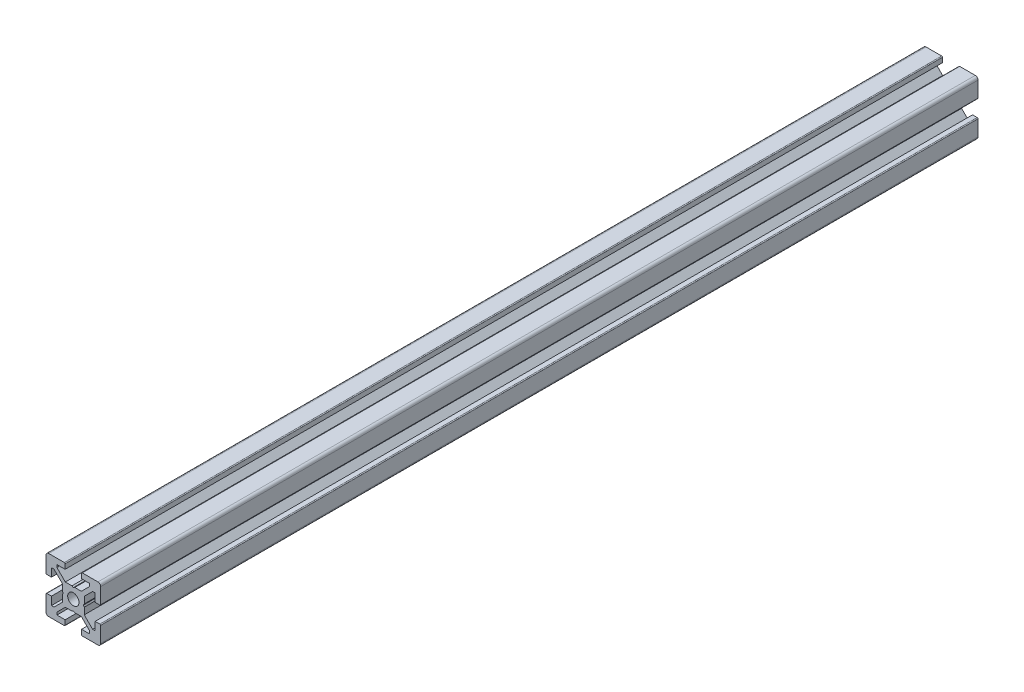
ISO-10303-21;
HEADER;
FILE_DESCRIPTION(('STEP AP214'),'2;1');
FILE_NAME('part.step','',(''),(''),'','','');
FILE_SCHEMA(('AUTOMOTIVE_DESIGN { 1 0 10303 214 1 1 1 1 }'));
ENDSEC;
DATA;
#1=APPLICATION_CONTEXT('core data for automotive mechanical design processes');
#2=APPLICATION_PROTOCOL_DEFINITION('international standard','automotive_design',2000,#1);
#3=PRODUCT_CONTEXT('',#1,'mechanical');
#4=PRODUCT('Part','Part','',(#3));
#5=PRODUCT_RELATED_PRODUCT_CATEGORY('part','',(#4));
#6=PRODUCT_DEFINITION_FORMATION('','',#4);
#7=PRODUCT_DEFINITION_CONTEXT('part definition',#1,'design');
#8=PRODUCT_DEFINITION('design','',#6,#7);
#9=PRODUCT_DEFINITION_SHAPE('','',#8);
#10=(LENGTH_UNIT() NAMED_UNIT(*) SI_UNIT(.MILLI.,.METRE.));
#11=(NAMED_UNIT(*) PLANE_ANGLE_UNIT() SI_UNIT($,.RADIAN.));
#12=(NAMED_UNIT(*) SI_UNIT($,.STERADIAN.) SOLID_ANGLE_UNIT());
#13=UNCERTAINTY_MEASURE_WITH_UNIT(LENGTH_MEASURE(1.E-05),#10,'distance_accuracy_value','');
#14=(GEOMETRIC_REPRESENTATION_CONTEXT(3) GLOBAL_UNCERTAINTY_ASSIGNED_CONTEXT((#13)) GLOBAL_UNIT_ASSIGNED_CONTEXT((#10,
#11,#12)) REPRESENTATION_CONTEXT('',''));
#15=CARTESIAN_POINT('',(0.,0.,0.));
#16=DIRECTION('',(0.,0.,1.));
#17=DIRECTION('',(1.,0.,0.));
#18=AXIS2_PLACEMENT_3D('',#15,#16,#17);
#19=CARTESIAN_POINT('',(-8.99999999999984,8.99999999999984,-321.000000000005));
#20=DIRECTION('',(0.,0.,1.00000000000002));
#21=DIRECTION('',(1.00000000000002,0.,0.));
#22=AXIS2_PLACEMENT_3D('',#19,#20,#21);
#23=PLANE('',#22);
#24=CARTESIAN_POINT('',(-8.99999999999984,8.99999999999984,-321.000000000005));
#25=DIRECTION('',(0.,0.,1.00000000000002));
#26=DIRECTION('',(1.00000000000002,0.,0.));
#27=AXIS2_PLACEMENT_3D('',#24,#25,#26);
#28=CIRCLE('',#27,1.00000000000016);
#29=CARTESIAN_POINT('',(-8.99999999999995,10.,-321.000000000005));
#30=VERTEX_POINT('',#29);
#31=CARTESIAN_POINT('',(-10.,8.99999999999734,-321.000000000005));
#32=VERTEX_POINT('',#31);
#33=EDGE_CURVE('E695',#30,#32,#28,.T.);
#34=ORIENTED_EDGE('',*,*,#33,.F.);
#35=DIRECTION('',(-1.00000000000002,0.,0.));
#36=VECTOR('',#35,1.);
#37=CARTESIAN_POINT('',(-3.29999999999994,9.99999999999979,-321.000000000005));
#38=LINE('',#37,#36);
#39=CARTESIAN_POINT('',(-3.29999999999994,9.99999999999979,-321.000000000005));
#40=VERTEX_POINT('',#39);
#41=EDGE_CURVE('E484',#40,#30,#38,.T.);
#42=ORIENTED_EDGE('',*,*,#41,.F.);
#43=CARTESIAN_POINT('',(-3.29999999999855,9.69999999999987,-321.000000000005));
#44=DIRECTION('',(0.,0.,1.00000000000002));
#45=DIRECTION('',(1.00000000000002,0.,0.));
#46=AXIS2_PLACEMENT_3D('',#43,#44,#45);
#47=CIRCLE('',#46,0.29999999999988);
#48=CARTESIAN_POINT('',(-2.99999999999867,9.69999999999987,-321.000000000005));
#49=VERTEX_POINT('',#48);
#50=EDGE_CURVE('E469',#49,#40,#47,.T.);
#51=ORIENTED_EDGE('',*,*,#50,.F.);
#52=DIRECTION('',(0.,1.,0.));
#53=VECTOR('',#52,1.);
#54=CARTESIAN_POINT('',(-2.99999999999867,8.00000000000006,-321.000000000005));
#55=LINE('',#54,#53);
#56=CARTESIAN_POINT('',(-2.99999999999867,8.00000000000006,-321.000000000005));
#57=VERTEX_POINT('',#56);
#58=EDGE_CURVE('E482',#57,#49,#55,.T.);
#59=ORIENTED_EDGE('',*,*,#58,.F.);
#60=DIRECTION('',(1.00000000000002,0.,0.));
#61=VECTOR('',#60,1.);
#62=CARTESIAN_POINT('',(-5.99999999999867,7.9999999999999,-321.000000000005));
#63=LINE('',#62,#61);
#64=CARTESIAN_POINT('',(-5.99999999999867,7.9999999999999,-321.000000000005));
#65=VERTEX_POINT('',#64);
#66=EDGE_CURVE('E487',#65,#57,#63,.T.);
#67=ORIENTED_EDGE('',*,*,#66,.F.);
#68=DIRECTION('',(0.,1.,0.));
#69=VECTOR('',#68,1.);
#70=CARTESIAN_POINT('',(-5.99999999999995,7.0606434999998,-321.000000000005));
#71=LINE('',#70,#69);
#72=CARTESIAN_POINT('',(-5.99999999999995,7.0606434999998,-321.000000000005));
#73=VERTEX_POINT('',#72);
#74=EDGE_CURVE('E489',#73,#65,#71,.T.);
#75=ORIENTED_EDGE('',*,*,#74,.F.);
#76=DIRECTION('',(-0.707106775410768,0.707106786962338,0.));
#77=VECTOR('',#76,1.);
#78=CARTESIAN_POINT('',(-2.93935654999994,3.99999999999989,-321.000000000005));
#79=LINE('',#78,#77);
#80=CARTESIAN_POINT('',(-2.93935654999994,3.99999999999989,-321.000000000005));
#81=VERTEX_POINT('',#80);
#82=EDGE_CURVE('E1042',#81,#73,#79,.T.);
#83=ORIENTED_EDGE('',*,*,#82,.F.);
#84=DIRECTION('',(-1.00000000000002,0.,0.));
#85=VECTOR('',#84,1.);
#86=CARTESIAN_POINT('',(-0.519628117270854,4.00000000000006,-321.000000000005));
#87=LINE('',#86,#85);
#88=CARTESIAN_POINT('',(-0.519628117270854,4.00000000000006,-321.000000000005));
#89=VERTEX_POINT('',#88);
#90=EDGE_CURVE('E1039',#89,#81,#87,.T.);
#91=ORIENTED_EDGE('',*,*,#90,.F.);
#92=DIRECTION('',(-0.866025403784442,0.500000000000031,0.));
#93=VECTOR('',#92,1.);
#94=CARTESIAN_POINT('',(-6.43749997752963E-06,3.69999628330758,-321.000000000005));
#95=LINE('',#94,#93);
#96=CARTESIAN_POINT('',(-6.43749997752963E-06,3.69999628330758,-321.000000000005));
#97=VERTEX_POINT('',#96);
#98=EDGE_CURVE('E1036',#97,#89,#95,.T.);
#99=ORIENTED_EDGE('',*,*,#98,.F.);
#100=DIRECTION('',(-0.866025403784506,-0.49999999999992,0.));
#101=VECTOR('',#100,1.);
#102=CARTESIAN_POINT('',(0.519615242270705,3.99999999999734,-321.000000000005));
#103=LINE('',#102,#101);
#104=CARTESIAN_POINT('',(0.519615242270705,3.99999999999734,-321.000000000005));
#105=VERTEX_POINT('',#104);
#106=EDGE_CURVE('E1033',#105,#97,#103,.T.);
#107=ORIENTED_EDGE('',*,*,#106,.F.);
#108=DIRECTION('',(-1.00000000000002,0.,0.));
#109=VECTOR('',#108,1.);
#110=CARTESIAN_POINT('',(2.93933079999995,3.99999999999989,-321.000000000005));
#111=LINE('',#110,#109);
#112=CARTESIAN_POINT('',(2.93933079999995,3.99999999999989,-321.000000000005));
#113=VERTEX_POINT('',#112);
#114=EDGE_CURVE('E1030',#113,#105,#111,.T.);
#115=ORIENTED_EDGE('',*,*,#114,.F.);
#116=DIRECTION('',(-0.707106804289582,-0.707106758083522,0.));
#117=VECTOR('',#116,1.);
#118=CARTESIAN_POINT('',(6.00000000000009,7.06066900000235,-321.000000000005));
#119=LINE('',#118,#117);
#120=CARTESIAN_POINT('',(6.00000000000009,7.06066900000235,-321.000000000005));
#121=VERTEX_POINT('',#120);
#122=EDGE_CURVE('E1027',#121,#113,#119,.T.);
#123=ORIENTED_EDGE('',*,*,#122,.F.);
#124=DIRECTION('',(0.,-1.,0.));
#125=VECTOR('',#124,1.);
#126=CARTESIAN_POINT('',(6.00000000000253,8.00000000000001,-321.000000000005));
#127=LINE('',#126,#125);
#128=CARTESIAN_POINT('',(6.00000000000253,8.00000000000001,-321.000000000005));
#129=VERTEX_POINT('',#128);
#130=EDGE_CURVE('E1024',#129,#121,#127,.T.);
#131=ORIENTED_EDGE('',*,*,#130,.F.);
#132=DIRECTION('',(1.00000000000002,0.,0.));
#133=VECTOR('',#132,1.);
#134=CARTESIAN_POINT('',(3.00000000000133,7.9999999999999,-321.000000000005));
#135=LINE('',#134,#133);
#136=CARTESIAN_POINT('',(3.00000000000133,7.9999999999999,-321.000000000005));
#137=VERTEX_POINT('',#136);
#138=EDGE_CURVE('E1021',#137,#129,#135,.T.);
#139=ORIENTED_EDGE('',*,*,#138,.F.);
#140=DIRECTION('',(0.,-1.,0.));
#141=VECTOR('',#140,1.);
#142=CARTESIAN_POINT('',(3.00000000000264,9.7000000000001,-321.000000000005));
#143=LINE('',#142,#141);
#144=CARTESIAN_POINT('',(3.00000000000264,9.7000000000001,-321.000000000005));
#145=VERTEX_POINT('',#144);
#146=EDGE_CURVE('E1018',#145,#137,#143,.T.);
#147=ORIENTED_EDGE('',*,*,#146,.F.);
#148=CARTESIAN_POINT('',(3.29999989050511,9.70000010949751,-321.000000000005));
#149=DIRECTION('',(0.,0.,1.00000000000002));
#150=DIRECTION('',(1.00000000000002,0.,0.));
#151=AXIS2_PLACEMENT_3D('',#148,#149,#150);
#152=CIRCLE('',#151,0.299999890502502);
#153=CARTESIAN_POINT('',(3.29999995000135,9.99999999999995,-321.000000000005));
#154=VERTEX_POINT('',#153);
#155=EDGE_CURVE('E1015',#154,#145,#152,.T.);
#156=ORIENTED_EDGE('',*,*,#155,.F.);
#157=DIRECTION('',(-1.00000000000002,0.,0.));
#158=VECTOR('',#157,1.);
#159=CARTESIAN_POINT('',(9.00000000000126,10.,-321.000000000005));
#160=LINE('',#159,#158);
#161=CARTESIAN_POINT('',(9.00000000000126,10.,-321.000000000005));
#162=VERTEX_POINT('',#161);
#163=EDGE_CURVE('E1012',#162,#154,#160,.T.);
#164=ORIENTED_EDGE('',*,*,#163,.F.);
#165=CARTESIAN_POINT('',(8.99999999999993,9.00000000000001,-321.000000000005));
#166=DIRECTION('',(0.,0.,1.00000000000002));
#167=DIRECTION('',(1.00000000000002,0.,0.));
#168=AXIS2_PLACEMENT_3D('',#165,#166,#167);
#169=CIRCLE('',#168,0.999999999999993);
#170=CARTESIAN_POINT('',(9.99999999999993,8.9999999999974,-321.000000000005));
#171=VERTEX_POINT('',#170);
#172=EDGE_CURVE('E1009',#171,#162,#169,.T.);
#173=ORIENTED_EDGE('',*,*,#172,.F.);
#174=DIRECTION('',(0.,1.,0.));
#175=VECTOR('',#174,1.);
#176=CARTESIAN_POINT('',(9.99999999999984,3.29999994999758,-321.000000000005));
#177=LINE('',#176,#175);
#178=CARTESIAN_POINT('',(9.99999999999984,3.29999994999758,-321.000000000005));
#179=VERTEX_POINT('',#178);
#180=EDGE_CURVE('E1006',#179,#171,#177,.T.);
#181=ORIENTED_EDGE('',*,*,#180,.F.);
#182=CARTESIAN_POINT('',(9.70000010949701,3.29999989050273,-321.000000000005));
#183=DIRECTION('',(0.,0.,1.00000000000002));
#184=DIRECTION('',(1.00000000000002,0.,0.));
#185=AXIS2_PLACEMENT_3D('',#182,#183,#184);
#186=CIRCLE('',#185,0.299999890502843);
#187=CARTESIAN_POINT('',(9.69999999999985,2.99999999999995,-321.000000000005));
#188=VERTEX_POINT('',#187);
#189=EDGE_CURVE('E1003',#188,#179,#186,.T.);
#190=ORIENTED_EDGE('',*,*,#189,.F.);
#191=DIRECTION('',(1.00000000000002,0.,0.));
#192=VECTOR('',#191,1.);
#193=CARTESIAN_POINT('',(7.99999999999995,2.99999999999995,-321.000000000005));
#194=LINE('',#193,#192);
#195=CARTESIAN_POINT('',(7.99999999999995,2.99999999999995,-321.000000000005));
#196=VERTEX_POINT('',#195);
#197=EDGE_CURVE('E1000',#196,#188,#194,.T.);
#198=ORIENTED_EDGE('',*,*,#197,.F.);
#199=DIRECTION('',(0.,-1.,0.));
#200=VECTOR('',#199,1.);
#201=CARTESIAN_POINT('',(7.99999999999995,5.99999999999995,-321.000000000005));
#202=LINE('',#201,#200);
#203=CARTESIAN_POINT('',(7.99999999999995,5.99999999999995,-321.000000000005));
#204=VERTEX_POINT('',#203);
#205=EDGE_CURVE('E997',#204,#196,#202,.T.);
#206=ORIENTED_EDGE('',*,*,#205,.F.);
#207=DIRECTION('',(1.00000000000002,0.,0.));
#208=VECTOR('',#207,1.);
#209=CARTESIAN_POINT('',(7.06065100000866,5.99999999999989,-321.000000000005));
#210=LINE('',#209,#208);
#211=CARTESIAN_POINT('',(7.06065100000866,5.99999999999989,-321.000000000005));
#212=VERTEX_POINT('',#211);
#213=EDGE_CURVE('E994',#212,#204,#210,.T.);
#214=ORIENTED_EDGE('',*,*,#213,.F.);
#215=DIRECTION('',(0.70710575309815,0.70710780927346,0.));
#216=VECTOR('',#215,1.);
#217=CARTESIAN_POINT('',(4.00000000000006,2.93934009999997,-321.000000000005));
#218=LINE('',#217,#216);
#219=CARTESIAN_POINT('',(4.00000000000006,2.93934009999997,-321.000000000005));
#220=VERTEX_POINT('',#219);
#221=EDGE_CURVE('E991',#220,#212,#218,.T.);
#222=ORIENTED_EDGE('',*,*,#221,.F.);
#223=DIRECTION('',(0.,1.,0.));
#224=VECTOR('',#223,1.);
#225=CARTESIAN_POINT('',(4.00000000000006,0.519628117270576,-321.000000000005));
#226=LINE('',#225,#224);
#227=CARTESIAN_POINT('',(4.00000000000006,0.519628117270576,-321.000000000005));
#228=VERTEX_POINT('',#227);
#229=EDGE_CURVE('E988',#228,#220,#226,.T.);
#230=ORIENTED_EDGE('',*,*,#229,.F.);
#231=DIRECTION('',(0.500000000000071,0.866025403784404,0.));
#232=VECTOR('',#231,1.);
#233=CARTESIAN_POINT('',(3.69999628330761,6.43749725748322E-06,-321.000000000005));
#234=LINE('',#233,#232);
#235=CARTESIAN_POINT('',(3.69999628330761,6.43749725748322E-06,-321.000000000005));
#236=VERTEX_POINT('',#235);
#237=EDGE_CURVE('E985',#236,#228,#234,.T.);
#238=ORIENTED_EDGE('',*,*,#237,.F.);
#239=DIRECTION('',(-0.500000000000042,0.86602540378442,0.));
#240=VECTOR('',#239,1.);
#241=CARTESIAN_POINT('',(4.00000000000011,-0.519615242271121,-321.000000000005));
#242=LINE('',#241,#240);
#243=CARTESIAN_POINT('',(4.00000000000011,-0.519615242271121,-321.000000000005));
#244=VERTEX_POINT('',#243);
#245=EDGE_CURVE('E982',#244,#236,#242,.T.);
#246=ORIENTED_EDGE('',*,*,#245,.F.);
#247=DIRECTION('',(0.,1.,0.));
#248=VECTOR('',#247,1.);
#249=CARTESIAN_POINT('',(4.00000000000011,-2.93934820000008,-321.000000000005));
#250=LINE('',#249,#248);
#251=CARTESIAN_POINT('',(4.00000000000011,-2.93934820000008,-321.000000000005));
#252=VERTEX_POINT('',#251);
#253=EDGE_CURVE('E979',#252,#244,#250,.T.);
#254=ORIENTED_EDGE('',*,*,#253,.F.);
#255=DIRECTION('',(-0.707105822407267,0.707107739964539,0.));
#256=VECTOR('',#255,1.);
#257=CARTESIAN_POINT('',(7.06064350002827,-5.99999999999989,-321.000000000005));
#258=LINE('',#257,#256);
#259=CARTESIAN_POINT('',(7.06064350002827,-5.99999999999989,-321.000000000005));
#260=VERTEX_POINT('',#259);
#261=EDGE_CURVE('E976',#260,#252,#258,.T.);
#262=ORIENTED_EDGE('',*,*,#261,.F.);
#263=DIRECTION('',(-1.00000000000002,0.,0.));
#264=VECTOR('',#263,1.);
#265=CARTESIAN_POINT('',(8.00000000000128,-5.99999999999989,-321.000000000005));
#266=LINE('',#265,#264);
#267=CARTESIAN_POINT('',(8.00000000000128,-5.99999999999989,-321.000000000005));
#268=VERTEX_POINT('',#267);
#269=EDGE_CURVE('E973',#268,#260,#266,.T.);
#270=ORIENTED_EDGE('',*,*,#269,.F.);
#271=DIRECTION('',(0.,-1.,0.));
#272=VECTOR('',#271,1.);
#273=CARTESIAN_POINT('',(8.00000000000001,-2.99999999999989,-321.000000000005));
#274=LINE('',#273,#272);
#275=CARTESIAN_POINT('',(8.00000000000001,-2.99999999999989,-321.000000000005));
#276=VERTEX_POINT('',#275);
#277=EDGE_CURVE('E970',#276,#268,#274,.T.);
#278=ORIENTED_EDGE('',*,*,#277,.F.);
#279=DIRECTION('',(-1.00000000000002,0.,0.));
#280=VECTOR('',#279,1.);
#281=CARTESIAN_POINT('',(9.6999999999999,-2.99999999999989,-321.000000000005));
#282=LINE('',#281,#280);
#283=CARTESIAN_POINT('',(9.6999999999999,-2.99999999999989,-321.000000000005));
#284=VERTEX_POINT('',#283);
#285=EDGE_CURVE('E967',#284,#276,#282,.T.);
#286=ORIENTED_EDGE('',*,*,#285,.F.);
#287=CARTESIAN_POINT('',(9.70000010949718,-3.2999998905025,-321.000000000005));
#288=DIRECTION('',(0.,0.,1.00000000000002));
#289=DIRECTION('',(1.00000000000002,0.,0.));
#290=AXIS2_PLACEMENT_3D('',#287,#288,#289);
#291=CIRCLE('',#290,0.299999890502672);
#292=CARTESIAN_POINT('',(9.99999999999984,-3.29999995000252,-321.000000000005));
#293=VERTEX_POINT('',#292);
#294=EDGE_CURVE('E964',#293,#284,#291,.T.);
#295=ORIENTED_EDGE('',*,*,#294,.F.);
#296=DIRECTION('',(0.,1.,0.));
#297=VECTOR('',#296,1.);
#298=CARTESIAN_POINT('',(10.0000000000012,-9.00000000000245,-321.000000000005));
#299=LINE('',#298,#297);
#300=CARTESIAN_POINT('',(10.0000000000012,-9.00000000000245,-321.000000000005));
#301=VERTEX_POINT('',#300);
#302=EDGE_CURVE('E961',#301,#293,#299,.T.);
#303=ORIENTED_EDGE('',*,*,#302,.F.);
#304=CARTESIAN_POINT('',(9.00000000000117,-9.00000000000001,-321.000000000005));
#305=DIRECTION('',(0.,0.,1.00000000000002));
#306=DIRECTION('',(1.00000000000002,0.,0.));
#307=AXIS2_PLACEMENT_3D('',#304,#305,#306);
#308=CIRCLE('',#307,0.999999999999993);
#309=CARTESIAN_POINT('',(9.00000000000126,-9.99999999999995,-321.000000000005));
#310=VERTEX_POINT('',#309);
#311=EDGE_CURVE('E958',#310,#301,#308,.T.);
#312=ORIENTED_EDGE('',*,*,#311,.F.);
#313=DIRECTION('',(1.00000000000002,0.,0.));
#314=VECTOR('',#313,1.);
#315=CARTESIAN_POINT('',(3.29999995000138,-10.,-321.000000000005));
#316=LINE('',#315,#314);
#317=CARTESIAN_POINT('',(3.29999995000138,-10.,-321.000000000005));
#318=VERTEX_POINT('',#317);
#319=EDGE_CURVE('E955',#318,#310,#316,.T.);
#320=ORIENTED_EDGE('',*,*,#319,.F.);
#321=CARTESIAN_POINT('',(3.29999989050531,-9.70000010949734,-321.000000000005));
#322=DIRECTION('',(0.,0.,1.00000000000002));
#323=DIRECTION('',(1.00000000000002,0.,0.));
#324=AXIS2_PLACEMENT_3D('',#321,#322,#323);
#325=CIRCLE('',#324,0.299999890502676);
#326=CARTESIAN_POINT('',(3.00000000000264,-9.70000000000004,-321.000000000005));
#327=VERTEX_POINT('',#326);
#328=EDGE_CURVE('E952',#327,#318,#325,.T.);
#329=ORIENTED_EDGE('',*,*,#328,.F.);
#330=DIRECTION('',(0.,-1.,0.));
#331=VECTOR('',#330,1.);
#332=CARTESIAN_POINT('',(3.00000000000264,-8.00000000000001,-321.000000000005));
#333=LINE('',#332,#331);
#334=CARTESIAN_POINT('',(3.00000000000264,-8.00000000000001,-321.000000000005));
#335=VERTEX_POINT('',#334);
#336=EDGE_CURVE('E949',#335,#327,#333,.T.);
#337=ORIENTED_EDGE('',*,*,#336,.F.);
#338=DIRECTION('',(-1.00000000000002,0.,0.));
#339=VECTOR('',#338,1.);
#340=CARTESIAN_POINT('',(6.00000000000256,-7.9999999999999,-321.000000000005));
#341=LINE('',#340,#339);
#342=CARTESIAN_POINT('',(6.00000000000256,-7.9999999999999,-321.000000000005));
#343=VERTEX_POINT('',#342);
#344=EDGE_CURVE('E946',#343,#335,#341,.T.);
#345=ORIENTED_EDGE('',*,*,#344,.F.);
#346=DIRECTION('',(0.,-1.,0.));
#347=VECTOR('',#346,1.);
#348=CARTESIAN_POINT('',(6.00000000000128,-7.0606769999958,-321.000000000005));
#349=LINE('',#348,#347);
#350=CARTESIAN_POINT('',(6.00000000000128,-7.0606769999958,-321.000000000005));
#351=VERTEX_POINT('',#350);
#352=EDGE_CURVE('E943',#351,#343,#349,.T.);
#353=ORIENTED_EDGE('',*,*,#352,.F.);
#354=DIRECTION('',(0.707106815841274,-0.707106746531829,0.));
#355=VECTOR('',#354,1.);
#356=CARTESIAN_POINT('',(2.9393226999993,-4.00000000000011,-321.000000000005));
#357=LINE('',#356,#355);
#358=CARTESIAN_POINT('',(2.9393226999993,-4.00000000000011,-321.000000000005));
#359=VERTEX_POINT('',#358);
#360=EDGE_CURVE('E940',#359,#351,#357,.T.);
#361=ORIENTED_EDGE('',*,*,#360,.F.);
#362=DIRECTION('',(1.00000000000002,0.,0.));
#363=VECTOR('',#362,1.);
#364=CARTESIAN_POINT('',(0.519628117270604,-4.00000000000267,-321.000000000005));
#365=LINE('',#364,#363);
#366=CARTESIAN_POINT('',(0.519628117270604,-4.00000000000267,-321.000000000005));
#367=VERTEX_POINT('',#366);
#368=EDGE_CURVE('E937',#367,#359,#365,.T.);
#369=ORIENTED_EDGE('',*,*,#368,.F.);
#370=DIRECTION('',(0.866025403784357,-0.500000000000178,0.));
#371=VECTOR('',#370,1.);
#372=CARTESIAN_POINT('',(6.43749994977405E-06,-3.69999628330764,-321.000000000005));
#373=LINE('',#372,#371);
#374=CARTESIAN_POINT('',(6.43749994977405E-06,-3.69999628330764,-321.000000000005));
#375=VERTEX_POINT('',#374);
#376=EDGE_CURVE('E934',#375,#367,#373,.T.);
#377=ORIENTED_EDGE('',*,*,#376,.F.);
#378=DIRECTION('',(0.86602540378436,0.500000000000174,0.));
#379=VECTOR('',#378,1.);
#380=CARTESIAN_POINT('',(-0.519615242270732,-4.00000000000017,-321.000000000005));
#381=LINE('',#380,#379);
#382=CARTESIAN_POINT('',(-0.519615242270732,-4.00000000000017,-321.000000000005));
#383=VERTEX_POINT('',#382);
#384=EDGE_CURVE('E931',#383,#375,#381,.T.);
#385=ORIENTED_EDGE('',*,*,#384,.F.);
#386=DIRECTION('',(1.00000000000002,0.,0.));
#387=VECTOR('',#386,1.);
#388=CARTESIAN_POINT('',(-2.93934889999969,-4.00000000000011,-321.000000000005));
#389=LINE('',#388,#387);
#390=CARTESIAN_POINT('',(-2.93934889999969,-4.00000000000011,-321.000000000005));
#391=VERTEX_POINT('',#390);
#392=EDGE_CURVE('E928',#391,#383,#389,.T.);
#393=ORIENTED_EDGE('',*,*,#392,.F.);
#394=DIRECTION('',(0.707106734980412,0.707106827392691,0.));
#395=VECTOR('',#394,1.);
#396=CARTESIAN_POINT('',(-5.99999999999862,-7.06065149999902,-321.000000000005));
#397=LINE('',#396,#395);
#398=CARTESIAN_POINT('',(-5.99999999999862,-7.06065149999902,-321.000000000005));
#399=VERTEX_POINT('',#398);
#400=EDGE_CURVE('E925',#399,#391,#397,.T.);
#401=ORIENTED_EDGE('',*,*,#400,.F.);
#402=DIRECTION('',(0.,1.,0.));
#403=VECTOR('',#402,1.);
#404=CARTESIAN_POINT('',(-5.99999999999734,-8.00000000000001,-321.000000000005));
#405=LINE('',#404,#403);
#406=CARTESIAN_POINT('',(-5.99999999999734,-8.00000000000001,-321.000000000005));
#407=VERTEX_POINT('',#406);
#408=EDGE_CURVE('E922',#407,#399,#405,.T.);
#409=ORIENTED_EDGE('',*,*,#408,.F.);
#410=DIRECTION('',(-1.00000000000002,0.,0.));
#411=VECTOR('',#410,1.);
#412=CARTESIAN_POINT('',(-2.99999999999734,-8.00000000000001,-321.000000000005));
#413=LINE('',#412,#411);
#414=CARTESIAN_POINT('',(-2.99999999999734,-8.00000000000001,-321.000000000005));
#415=VERTEX_POINT('',#414);
#416=EDGE_CURVE('E919',#415,#407,#413,.T.);
#417=ORIENTED_EDGE('',*,*,#416,.F.);
#418=DIRECTION('',(0.,1.,0.));
#419=VECTOR('',#418,1.);
#420=CARTESIAN_POINT('',(-2.99999999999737,-9.70000000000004,-321.000000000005));
#421=LINE('',#420,#419);
#422=CARTESIAN_POINT('',(-2.99999999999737,-9.70000000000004,-321.000000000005));
#423=VERTEX_POINT('',#422);
#424=EDGE_CURVE('E916',#423,#415,#421,.T.);
#425=ORIENTED_EDGE('',*,*,#424,.F.);
#426=CARTESIAN_POINT('',(-3.2999998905,-9.70000010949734,-321.000000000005));
#427=DIRECTION('',(0.,0.,1.00000000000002));
#428=DIRECTION('',(1.00000000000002,0.,0.));
#429=AXIS2_PLACEMENT_3D('',#426,#427,#428);
#430=CIRCLE('',#429,0.299999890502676);
#431=CARTESIAN_POINT('',(-3.29999994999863,-10.,-321.000000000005));
#432=VERTEX_POINT('',#431);
#433=EDGE_CURVE('E913',#432,#423,#430,.T.);
#434=ORIENTED_EDGE('',*,*,#433,.F.);
#435=DIRECTION('',(1.00000000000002,0.,0.));
#436=VECTOR('',#435,1.);
#437=CARTESIAN_POINT('',(-8.99999999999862,-10.,-321.000000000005));
#438=LINE('',#437,#436);
#439=CARTESIAN_POINT('',(-8.99999999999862,-10.,-321.000000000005));
#440=VERTEX_POINT('',#439);
#441=EDGE_CURVE('E910',#440,#432,#438,.T.);
#442=ORIENTED_EDGE('',*,*,#441,.F.);
#443=CARTESIAN_POINT('',(-8.99999999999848,-8.99999999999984,-321.000000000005));
#444=DIRECTION('',(0.,0.,1.00000000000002));
#445=DIRECTION('',(1.00000000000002,0.,0.));
#446=AXIS2_PLACEMENT_3D('',#443,#444,#445);
#447=CIRCLE('',#446,1.00000000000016);
#448=CARTESIAN_POINT('',(-9.99999999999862,-9.00000000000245,-321.000000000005));
#449=VERTEX_POINT('',#448);
#450=EDGE_CURVE('E907',#449,#440,#447,.T.);
#451=ORIENTED_EDGE('',*,*,#450,.F.);
#452=DIRECTION('',(0.,-1.,0.));
#453=VECTOR('',#452,1.);
#454=CARTESIAN_POINT('',(-9.99999999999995,-3.29999995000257,-321.000000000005));
#455=LINE('',#454,#453);
#456=CARTESIAN_POINT('',(-9.99999999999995,-3.29999995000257,-321.000000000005));
#457=VERTEX_POINT('',#456);
#458=EDGE_CURVE('E904',#457,#449,#455,.T.);
#459=ORIENTED_EDGE('',*,*,#458,.F.);
#460=CARTESIAN_POINT('',(-9.70000010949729,-3.29999989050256,-321.000000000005));
#461=DIRECTION('',(0.,0.,1.00000000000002));
#462=DIRECTION('',(1.00000000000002,0.,0.));
#463=AXIS2_PLACEMENT_3D('',#460,#461,#462);
#464=CIRCLE('',#463,0.299999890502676);
#465=CARTESIAN_POINT('',(-9.6999999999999,-2.99999999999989,-321.000000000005));
#466=VERTEX_POINT('',#465);
#467=EDGE_CURVE('E901',#466,#457,#464,.T.);
#468=ORIENTED_EDGE('',*,*,#467,.F.);
#469=DIRECTION('',(-1.00000000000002,0.,0.));
#470=VECTOR('',#469,1.);
#471=CARTESIAN_POINT('',(-7.9999999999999,-2.99999999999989,-321.000000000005));
#472=LINE('',#471,#470);
#473=CARTESIAN_POINT('',(-7.9999999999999,-2.99999999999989,-321.000000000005));
#474=VERTEX_POINT('',#473);
#475=EDGE_CURVE('E898',#474,#466,#472,.T.);
#476=ORIENTED_EDGE('',*,*,#475,.F.);
#477=DIRECTION('',(0.,1.,0.));
#478=VECTOR('',#477,1.);
#479=CARTESIAN_POINT('',(-7.99999999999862,-5.99999999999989,-321.000000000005));
#480=LINE('',#479,#478);
#481=CARTESIAN_POINT('',(-7.99999999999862,-5.99999999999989,-321.000000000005));
#482=VERTEX_POINT('',#481);
#483=EDGE_CURVE('E895',#482,#474,#480,.T.);
#484=ORIENTED_EDGE('',*,*,#483,.F.);
#485=DIRECTION('',(-1.00000000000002,0.,0.));
#486=VECTOR('',#485,1.);
#487=CARTESIAN_POINT('',(-7.06066950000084,-6.00000000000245,-321.000000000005));
#488=LINE('',#487,#486);
#489=CARTESIAN_POINT('',(-7.06066950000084,-6.00000000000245,-321.000000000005));
#490=VERTEX_POINT('',#489);
#491=EDGE_CURVE('E892',#490,#482,#488,.T.);
#492=ORIENTED_EDGE('',*,*,#491,.F.);
#493=DIRECTION('',(-0.70710756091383,-0.707106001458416,0.));
#494=VECTOR('',#493,1.);
#495=CARTESIAN_POINT('',(-3.99999999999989,-2.93933725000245,-321.000000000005));
#496=LINE('',#495,#494);
#497=CARTESIAN_POINT('',(-3.99999999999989,-2.93933725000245,-321.000000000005));
#498=VERTEX_POINT('',#497);
#499=EDGE_CURVE('E889',#498,#490,#496,.T.);
#500=ORIENTED_EDGE('',*,*,#499,.F.);
#501=DIRECTION('',(0.,-1.,0.));
#502=VECTOR('',#501,1.);
#503=CARTESIAN_POINT('',(-3.99999999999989,-0.519628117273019,-321.000000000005));
#504=LINE('',#503,#502);
#505=CARTESIAN_POINT('',(-3.99999999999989,-0.519628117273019,-321.000000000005));
#506=VERTEX_POINT('',#505);
#507=EDGE_CURVE('E886',#506,#498,#504,.T.);
#508=ORIENTED_EDGE('',*,*,#507,.F.);
#509=DIRECTION('',(-0.500000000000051,-0.866025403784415,0.));
#510=VECTOR('',#509,1.);
#511=CARTESIAN_POINT('',(-3.69999628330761,-6.43750003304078E-06,-321.000000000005));
#512=LINE('',#511,#510);
#513=CARTESIAN_POINT('',(-3.69999628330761,-6.43750003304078E-06,-321.000000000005));
#514=VERTEX_POINT('',#513);
#515=EDGE_CURVE('E883',#514,#506,#512,.T.);
#516=ORIENTED_EDGE('',*,*,#515,.F.);
#517=DIRECTION('',(0.500000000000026,-0.86602540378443,0.));
#518=VECTOR('',#517,1.);
#519=CARTESIAN_POINT('',(-3.99999999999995,0.519615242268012,-321.000000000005));
#520=LINE('',#519,#518);
#521=CARTESIAN_POINT('',(-3.99999999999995,0.519615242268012,-321.000000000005));
#522=VERTEX_POINT('',#521);
#523=EDGE_CURVE('E880',#522,#514,#520,.T.);
#524=ORIENTED_EDGE('',*,*,#523,.F.);
#525=DIRECTION('',(0.,-1.,0.));
#526=VECTOR('',#525,1.);
#527=CARTESIAN_POINT('',(-3.99999999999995,2.93932965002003,-321.000000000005));
#528=LINE('',#527,#526);
#529=CARTESIAN_POINT('',(-3.99999999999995,2.93932965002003,-321.000000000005));
#530=VERTEX_POINT('',#529);
#531=EDGE_CURVE('E877',#530,#522,#528,.T.);
#532=ORIENTED_EDGE('',*,*,#531,.F.);
#533=DIRECTION('',(0.707107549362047,-0.707106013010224,0.));
#534=VECTOR('',#533,1.);
#535=CARTESIAN_POINT('',(-7.06067699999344,5.99999999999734,-321.000000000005));
#536=LINE('',#535,#534);
#537=CARTESIAN_POINT('',(-7.06067699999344,5.99999999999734,-321.000000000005));
#538=VERTEX_POINT('',#537);
#539=EDGE_CURVE('E874',#538,#530,#536,.T.);
#540=ORIENTED_EDGE('',*,*,#539,.F.);
#541=DIRECTION('',(1.00000000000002,0.,0.));
#542=VECTOR('',#541,1.);
#543=CARTESIAN_POINT('',(-7.99999999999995,5.99999999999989,-321.000000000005));
#544=LINE('',#543,#542);
#545=CARTESIAN_POINT('',(-7.99999999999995,5.99999999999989,-321.000000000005));
#546=VERTEX_POINT('',#545);
#547=EDGE_CURVE('E871',#546,#538,#544,.T.);
#548=ORIENTED_EDGE('',*,*,#547,.F.);
#549=DIRECTION('',(0.,1.,0.));
#550=VECTOR('',#549,1.);
#551=CARTESIAN_POINT('',(-7.99999999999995,2.99999999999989,-321.000000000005));
#552=LINE('',#551,#550);
#553=CARTESIAN_POINT('',(-7.99999999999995,2.99999999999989,-321.000000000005));
#554=VERTEX_POINT('',#553);
#555=EDGE_CURVE('E868',#554,#546,#552,.T.);
#556=ORIENTED_EDGE('',*,*,#555,.F.);
#557=DIRECTION('',(1.00000000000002,0.,0.));
#558=VECTOR('',#557,1.);
#559=CARTESIAN_POINT('',(-9.69999999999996,2.99999999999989,-321.000000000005));
#560=LINE('',#559,#558);
#561=CARTESIAN_POINT('',(-9.69999999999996,2.99999999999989,-321.000000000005));
#562=VERTEX_POINT('',#561);
#563=EDGE_CURVE('E865',#562,#554,#560,.T.);
#564=ORIENTED_EDGE('',*,*,#563,.F.);
#565=CARTESIAN_POINT('',(-9.70000010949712,3.29999989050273,-321.000000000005));
#566=DIRECTION('',(0.,0.,1.00000000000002));
#567=DIRECTION('',(1.00000000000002,0.,0.));
#568=AXIS2_PLACEMENT_3D('',#565,#566,#567);
#569=CIRCLE('',#568,0.299999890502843);
#570=CARTESIAN_POINT('',(-9.99999999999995,3.29999994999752,-321.000000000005));
#571=VERTEX_POINT('',#570);
#572=EDGE_CURVE('E862',#571,#562,#569,.T.);
#573=ORIENTED_EDGE('',*,*,#572,.F.);
#574=DIRECTION('',(0.,-1.,0.));
#575=VECTOR('',#574,1.);
#576=CARTESIAN_POINT('',(-10.,8.99999999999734,-321.000000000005));
#577=LINE('',#576,#575);
#578=EDGE_CURVE('E860',#32,#571,#577,.T.);
#579=ORIENTED_EDGE('',*,*,#578,.F.);
#580=EDGE_LOOP('',(#34,#42,#51,#59,#67,#75,#83,#91,#99,#107,#115,#123,#131,#139,#147,#156,#164,
#173,#181,#190,#198,#206,#214,#222,#230,#238,#246,#254,#262,#270,#278,#286,#295,#303,#312,#320,
#329,#337,#345,#353,#361,#369,#377,#385,#393,#401,#409,#417,#425,#434,#442,#451,#459,#468,#476,
#484,#492,#500,#508,#516,#524,#532,#540,#548,#556,#564,#573,#579));
#581=FACE_BOUND('',#580,.T.);
#582=CARTESIAN_POINT('',(0.,0.,-321.000000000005));
#583=DIRECTION('',(0.,0.,1.00000000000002));
#584=DIRECTION('',(0.,-1.,0.));
#585=AXIS2_PLACEMENT_3D('',#582,#583,#584);
#586=CIRCLE('',#585,2.06699999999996);
#587=CARTESIAN_POINT('',(0.,-2.06699999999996,-321.000000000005));
#588=VERTEX_POINT('',#587);
#589=EDGE_CURVE('E855',#588,#588,#586,.T.);
#590=ORIENTED_EDGE('',*,*,#589,.T.);
#591=EDGE_LOOP('',(#590));
#592=FACE_BOUND('',#591,.T.);
#593=ADVANCED_FACE('F36',(#581,#592),#23,.F.);
#594=CARTESIAN_POINT('',(-8.99999999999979,8.99999999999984,1.27675647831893E-12));
#595=DIRECTION('',(0.,0.,1.00000000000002));
#596=DIRECTION('',(1.00000000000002,0.,0.));
#597=AXIS2_PLACEMENT_3D('',#594,#595,#596);
#598=PLANE('',#597);
#599=CARTESIAN_POINT('',(-8.99999999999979,8.99999999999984,1.27675647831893E-12));
#600=DIRECTION('',(0.,0.,1.00000000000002));
#601=DIRECTION('',(1.00000000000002,0.,0.));
#602=AXIS2_PLACEMENT_3D('',#599,#600,#601);
#603=CIRCLE('',#602,1.00000000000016);
#604=CARTESIAN_POINT('',(-8.99999999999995,10.,0.));
#605=VERTEX_POINT('',#604);
#606=CARTESIAN_POINT('',(-9.99999999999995,8.99999999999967,1.27675647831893E-12));
#607=VERTEX_POINT('',#606);
#608=EDGE_CURVE('E494',#605,#607,#603,.T.);
#609=ORIENTED_EDGE('',*,*,#608,.T.);
#610=DIRECTION('',(0.,-1.,0.));
#611=VECTOR('',#610,1.);
#612=CARTESIAN_POINT('',(-9.99999999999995,8.99999999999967,1.27675647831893E-12));
#613=LINE('',#612,#611);
#614=CARTESIAN_POINT('',(-9.99999999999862,3.29999995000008,0.));
#615=VERTEX_POINT('',#614);
#616=EDGE_CURVE('E497',#607,#615,#613,.T.);
#617=ORIENTED_EDGE('',*,*,#616,.T.);
#618=CARTESIAN_POINT('',(-9.70000010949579,3.29999989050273,0.));
#619=DIRECTION('',(0.,0.,1.00000000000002));
#620=DIRECTION('',(1.00000000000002,0.,0.));
#621=AXIS2_PLACEMENT_3D('',#618,#619,#620);
#622=CIRCLE('',#621,0.299999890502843);
#623=CARTESIAN_POINT('',(-9.6999999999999,2.99999999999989,-1.27675647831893E-12));
#624=VERTEX_POINT('',#623);
#625=EDGE_CURVE('E501',#615,#624,#622,.T.);
#626=ORIENTED_EDGE('',*,*,#625,.T.);
#627=DIRECTION('',(1.00000000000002,0.,0.));
#628=VECTOR('',#627,1.);
#629=CARTESIAN_POINT('',(-9.6999999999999,2.99999999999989,-1.27675647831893E-12));
#630=LINE('',#629,#628);
#631=CARTESIAN_POINT('',(-7.9999999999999,2.99999999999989,-1.27675647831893E-12));
#632=VERTEX_POINT('',#631);
#633=EDGE_CURVE('E504',#624,#632,#630,.T.);
#634=ORIENTED_EDGE('',*,*,#633,.T.);
#635=DIRECTION('',(0.,1.,0.));
#636=VECTOR('',#635,1.);
#637=CARTESIAN_POINT('',(-7.9999999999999,2.99999999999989,-1.27675647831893E-12));
#638=LINE('',#637,#636);
#639=CARTESIAN_POINT('',(-7.9999999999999,5.99999999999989,0.));
#640=VERTEX_POINT('',#639);
#641=EDGE_CURVE('E507',#632,#640,#638,.T.);
#642=ORIENTED_EDGE('',*,*,#641,.T.);
#643=DIRECTION('',(1.00000000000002,0.,0.));
#644=VECTOR('',#643,1.);
#645=CARTESIAN_POINT('',(-7.9999999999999,5.99999999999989,0.));
#646=LINE('',#645,#644);
#647=CARTESIAN_POINT('',(-7.06067699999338,5.99999999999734,0.));
#648=VERTEX_POINT('',#647);
#649=EDGE_CURVE('E510',#640,#648,#646,.T.);
#650=ORIENTED_EDGE('',*,*,#649,.T.);
#651=DIRECTION('',(0.707107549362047,-0.707106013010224,0.));
#652=VECTOR('',#651,1.);
#653=CARTESIAN_POINT('',(-7.06067699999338,5.99999999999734,0.));
#654=LINE('',#653,#652);
#655=CARTESIAN_POINT('',(-3.99999999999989,2.93932965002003,0.));
#656=VERTEX_POINT('',#655);
#657=EDGE_CURVE('E513',#648,#656,#654,.T.);
#658=ORIENTED_EDGE('',*,*,#657,.T.);
#659=DIRECTION('',(0.,-1.,0.));
#660=VECTOR('',#659,1.);
#661=CARTESIAN_POINT('',(-3.99999999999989,2.93932965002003,0.));
#662=LINE('',#661,#660);
#663=CARTESIAN_POINT('',(-3.99999999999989,0.519615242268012,1.33226762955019E-12));
#664=VERTEX_POINT('',#663);
#665=EDGE_CURVE('E516',#656,#664,#662,.T.);
#666=ORIENTED_EDGE('',*,*,#665,.T.);
#667=DIRECTION('',(0.500000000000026,-0.86602540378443,0.));
#668=VECTOR('',#667,1.);
#669=CARTESIAN_POINT('',(-3.99999999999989,0.519615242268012,1.33226762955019E-12));
#670=LINE('',#669,#668);
#671=CARTESIAN_POINT('',(-3.69999628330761,-6.43749997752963E-06,0.));
#672=VERTEX_POINT('',#671);
#673=EDGE_CURVE('E519',#664,#672,#670,.T.);
#674=ORIENTED_EDGE('',*,*,#673,.T.);
#675=DIRECTION('',(-0.500000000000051,-0.866025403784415,0.));
#676=VECTOR('',#675,1.);
#677=CARTESIAN_POINT('',(-3.69999628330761,-6.43749997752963E-06,0.));
#678=LINE('',#677,#676);
#679=CARTESIAN_POINT('',(-3.99999999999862,-0.519628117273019,-1.27675647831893E-12));
#680=VERTEX_POINT('',#679);
#681=EDGE_CURVE('E522',#672,#680,#678,.T.);
#682=ORIENTED_EDGE('',*,*,#681,.T.);
#683=DIRECTION('',(0.,-1.,0.));
#684=VECTOR('',#683,1.);
#685=CARTESIAN_POINT('',(-3.99999999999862,-0.519628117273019,-1.27675647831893E-12));
#686=LINE('',#685,#684);
#687=CARTESIAN_POINT('',(-3.99999999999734,-2.93933725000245,0.));
#688=VERTEX_POINT('',#687);
#689=EDGE_CURVE('E525',#680,#688,#686,.T.);
#690=ORIENTED_EDGE('',*,*,#689,.T.);
#691=DIRECTION('',(-0.70710756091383,-0.707106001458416,0.));
#692=VECTOR('',#691,1.);
#693=CARTESIAN_POINT('',(-3.99999999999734,-2.93933725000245,0.));
#694=LINE('',#693,#692);
#695=CARTESIAN_POINT('',(-7.06066949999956,-6.00000000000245,-1.27675647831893E-12));
#696=VERTEX_POINT('',#695);
#697=EDGE_CURVE('E528',#688,#696,#694,.T.);
#698=ORIENTED_EDGE('',*,*,#697,.T.);
#699=DIRECTION('',(-1.00000000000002,0.,0.));
#700=VECTOR('',#699,1.);
#701=CARTESIAN_POINT('',(-7.06066949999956,-6.00000000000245,-1.27675647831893E-12));
#702=LINE('',#701,#700);
#703=CARTESIAN_POINT('',(-7.99999999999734,-5.99999999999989,-1.27675647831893E-12));
#704=VERTEX_POINT('',#703);
#705=EDGE_CURVE('E531',#696,#704,#702,.T.);
#706=ORIENTED_EDGE('',*,*,#705,.T.);
#707=DIRECTION('',(0.,1.,0.));
#708=VECTOR('',#707,1.);
#709=CARTESIAN_POINT('',(-7.99999999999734,-5.99999999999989,-1.27675647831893E-12));
#710=LINE('',#709,#708);
#711=CARTESIAN_POINT('',(-7.99999999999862,-2.99999999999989,0.));
#712=VERTEX_POINT('',#711);
#713=EDGE_CURVE('E534',#704,#712,#710,.T.);
#714=ORIENTED_EDGE('',*,*,#713,.T.);
#715=DIRECTION('',(-1.00000000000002,0.,0.));
#716=VECTOR('',#715,1.);
#717=CARTESIAN_POINT('',(-7.99999999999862,-2.99999999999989,0.));
#718=LINE('',#717,#716);
#719=CARTESIAN_POINT('',(-9.69999999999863,-2.99999999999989,0.));
#720=VERTEX_POINT('',#719);
#721=EDGE_CURVE('E537',#712,#720,#718,.T.);
#722=ORIENTED_EDGE('',*,*,#721,.T.);
#723=CARTESIAN_POINT('',(-9.70000010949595,-3.29999989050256,0.));
#724=DIRECTION('',(0.,0.,1.00000000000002));
#725=DIRECTION('',(1.00000000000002,0.,0.));
#726=AXIS2_PLACEMENT_3D('',#723,#724,#725);
#727=CIRCLE('',#726,0.299999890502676);
#728=CARTESIAN_POINT('',(-9.99999999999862,-3.29999994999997,0.));
#729=VERTEX_POINT('',#728);
#730=EDGE_CURVE('E540',#720,#729,#727,.T.);
#731=ORIENTED_EDGE('',*,*,#730,.T.);
#732=DIRECTION('',(0.,-1.,0.));
#733=VECTOR('',#732,1.);
#734=CARTESIAN_POINT('',(-9.99999999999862,-3.29999994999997,0.));
#735=LINE('',#734,#733);
#736=CARTESIAN_POINT('',(-9.99999999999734,-9.00000000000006,0.));
#737=VERTEX_POINT('',#736);
#738=EDGE_CURVE('E543',#729,#737,#735,.T.);
#739=ORIENTED_EDGE('',*,*,#738,.T.);
#740=CARTESIAN_POINT('',(-8.9999999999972,-8.99999999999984,0.));
#741=DIRECTION('',(0.,0.,1.00000000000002));
#742=DIRECTION('',(1.00000000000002,0.,0.));
#743=AXIS2_PLACEMENT_3D('',#740,#741,#742);
#744=CIRCLE('',#743,1.00000000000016);
#745=CARTESIAN_POINT('',(-8.99999999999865,-10.,0.));
#746=VERTEX_POINT('',#745);
#747=EDGE_CURVE('E546',#737,#746,#744,.T.);
#748=ORIENTED_EDGE('',*,*,#747,.T.);
#749=DIRECTION('',(1.00000000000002,0.,0.));
#750=VECTOR('',#749,1.);
#751=CARTESIAN_POINT('',(-8.99999999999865,-10.,0.));
#752=LINE('',#751,#750);
#753=CARTESIAN_POINT('',(-3.29999994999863,-10.,0.));
#754=VERTEX_POINT('',#753);
#755=EDGE_CURVE('E549',#746,#754,#752,.T.);
#756=ORIENTED_EDGE('',*,*,#755,.T.);
#757=CARTESIAN_POINT('',(-3.2999998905,-9.70000010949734,0.));
#758=DIRECTION('',(0.,0.,1.00000000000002));
#759=DIRECTION('',(1.00000000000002,0.,0.));
#760=AXIS2_PLACEMENT_3D('',#757,#758,#759);
#761=CIRCLE('',#760,0.299999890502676);
#762=CARTESIAN_POINT('',(-2.99999999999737,-9.69999999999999,0.));
#763=VERTEX_POINT('',#762);
#764=EDGE_CURVE('E552',#754,#763,#761,.T.);
#765=ORIENTED_EDGE('',*,*,#764,.T.);
#766=DIRECTION('',(0.,1.,0.));
#767=VECTOR('',#766,1.);
#768=CARTESIAN_POINT('',(-2.99999999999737,-9.69999999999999,0.));
#769=LINE('',#768,#767);
#770=CARTESIAN_POINT('',(-2.99999999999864,-8.00000000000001,0.));
#771=VERTEX_POINT('',#770);
#772=EDGE_CURVE('E555',#763,#771,#769,.T.);
#773=ORIENTED_EDGE('',*,*,#772,.T.);
#774=DIRECTION('',(-1.00000000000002,0.,0.));
#775=VECTOR('',#774,1.);
#776=CARTESIAN_POINT('',(-2.99999999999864,-8.00000000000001,0.));
#777=LINE('',#776,#775);
#778=CARTESIAN_POINT('',(-5.99999999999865,-8.00000000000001,1.33226762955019E-12));
#779=VERTEX_POINT('',#778);
#780=EDGE_CURVE('E558',#771,#779,#777,.T.);
#781=ORIENTED_EDGE('',*,*,#780,.T.);
#782=DIRECTION('',(0.,1.,0.));
#783=VECTOR('',#782,1.);
#784=CARTESIAN_POINT('',(-5.99999999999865,-8.00000000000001,1.33226762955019E-12));
#785=LINE('',#784,#783);
#786=CARTESIAN_POINT('',(-5.99999999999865,-7.06065149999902,-1.27675647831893E-12));
#787=VERTEX_POINT('',#786);
#788=EDGE_CURVE('E561',#779,#787,#785,.T.);
#789=ORIENTED_EDGE('',*,*,#788,.T.);
#790=DIRECTION('',(0.707106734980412,0.707106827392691,0.));
#791=VECTOR('',#790,1.);
#792=CARTESIAN_POINT('',(-5.99999999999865,-7.06065149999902,-1.27675647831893E-12));
#793=LINE('',#792,#791);
#794=CARTESIAN_POINT('',(-2.93934889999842,-4.00000000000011,-1.27675647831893E-12));
#795=VERTEX_POINT('',#794);
#796=EDGE_CURVE('E564',#787,#795,#793,.T.);
#797=ORIENTED_EDGE('',*,*,#796,.T.);
#798=DIRECTION('',(1.00000000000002,0.,0.));
#799=VECTOR('',#798,1.);
#800=CARTESIAN_POINT('',(-2.93934889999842,-4.00000000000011,-1.27675647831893E-12));
#801=LINE('',#800,#799);
#802=CARTESIAN_POINT('',(-0.519615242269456,-4.00000000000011,-1.27675647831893E-12));
#803=VERTEX_POINT('',#802);
#804=EDGE_CURVE('E567',#795,#803,#801,.T.);
#805=ORIENTED_EDGE('',*,*,#804,.T.);
#806=DIRECTION('',(0.86602540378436,0.500000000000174,0.));
#807=VECTOR('',#806,1.);
#808=CARTESIAN_POINT('',(-0.519615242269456,-4.00000000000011,-1.27675647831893E-12));
#809=LINE('',#808,#807);
#810=CARTESIAN_POINT('',(6.43750250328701E-06,-3.69999628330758,-1.27675647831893E-12));
#811=VERTEX_POINT('',#810);
#812=EDGE_CURVE('E570',#803,#811,#809,.T.);
#813=ORIENTED_EDGE('',*,*,#812,.T.);
#814=DIRECTION('',(0.866025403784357,-0.500000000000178,0.));
#815=VECTOR('',#814,1.);
#816=CARTESIAN_POINT('',(6.43750250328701E-06,-3.69999628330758,-1.27675647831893E-12));
#817=LINE('',#816,#815);
#818=CARTESIAN_POINT('',(0.519628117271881,-4.00000000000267,-1.27675647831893E-12));
#819=VERTEX_POINT('',#818);
#820=EDGE_CURVE('E573',#811,#819,#817,.T.);
#821=ORIENTED_EDGE('',*,*,#820,.T.);
#822=DIRECTION('',(1.00000000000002,0.,0.));
#823=VECTOR('',#822,1.);
#824=CARTESIAN_POINT('',(0.519628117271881,-4.00000000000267,-1.27675647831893E-12));
#825=LINE('',#824,#823);
#826=CARTESIAN_POINT('',(2.93932270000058,-4.00000000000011,-1.27675647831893E-12));
#827=VERTEX_POINT('',#826);
#828=EDGE_CURVE('E576',#819,#827,#825,.T.);
#829=ORIENTED_EDGE('',*,*,#828,.T.);
#830=DIRECTION('',(0.707106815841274,-0.707106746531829,0.));
#831=VECTOR('',#830,1.);
#832=CARTESIAN_POINT('',(2.93932270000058,-4.00000000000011,-1.27675647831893E-12));
#833=LINE('',#832,#831);
#834=CARTESIAN_POINT('',(6.00000000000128,-7.06067699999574,-1.27675647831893E-12));
#835=VERTEX_POINT('',#834);
#836=EDGE_CURVE('E579',#827,#835,#833,.T.);
#837=ORIENTED_EDGE('',*,*,#836,.T.);
#838=DIRECTION('',(0.,-1.,0.));
#839=VECTOR('',#838,1.);
#840=CARTESIAN_POINT('',(6.00000000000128,-7.06067699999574,-1.27675647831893E-12));
#841=LINE('',#840,#839);
#842=CARTESIAN_POINT('',(6.00000000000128,-7.99999999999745,0.));
#843=VERTEX_POINT('',#842);
#844=EDGE_CURVE('E582',#835,#843,#841,.T.);
#845=ORIENTED_EDGE('',*,*,#844,.T.);
#846=DIRECTION('',(-1.00000000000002,0.,0.));
#847=VECTOR('',#846,1.);
#848=CARTESIAN_POINT('',(6.00000000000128,-7.99999999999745,0.));
#849=LINE('',#848,#847);
#850=CARTESIAN_POINT('',(3.00000000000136,-8.00000000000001,0.));
#851=VERTEX_POINT('',#850);
#852=EDGE_CURVE('E585',#843,#851,#849,.T.);
#853=ORIENTED_EDGE('',*,*,#852,.T.);
#854=DIRECTION('',(0.,-1.,0.));
#855=VECTOR('',#854,1.);
#856=CARTESIAN_POINT('',(3.00000000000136,-8.00000000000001,0.));
#857=LINE('',#856,#855);
#858=CARTESIAN_POINT('',(3.00000000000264,-9.69999999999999,0.));
#859=VERTEX_POINT('',#858);
#860=EDGE_CURVE('E588',#851,#859,#857,.T.);
#861=ORIENTED_EDGE('',*,*,#860,.T.);
#862=CARTESIAN_POINT('',(3.29999989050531,-9.70000010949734,0.));
#863=DIRECTION('',(0.,0.,1.00000000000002));
#864=DIRECTION('',(1.00000000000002,0.,0.));
#865=AXIS2_PLACEMENT_3D('',#862,#863,#864);
#866=CIRCLE('',#865,0.299999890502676);
#867=CARTESIAN_POINT('',(3.29999995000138,-10.,0.));
#868=VERTEX_POINT('',#867);
#869=EDGE_CURVE('E591',#859,#868,#866,.T.);
#870=ORIENTED_EDGE('',*,*,#869,.T.);
#871=DIRECTION('',(1.00000000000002,0.,0.));
#872=VECTOR('',#871,1.);
#873=CARTESIAN_POINT('',(3.29999995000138,-10.,0.));
#874=LINE('',#873,#872);
#875=CARTESIAN_POINT('',(9.00000000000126,-9.99999999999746,-1.27675647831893E-12));
#876=VERTEX_POINT('',#875);
#877=EDGE_CURVE('E594',#868,#876,#874,.T.);
#878=ORIENTED_EDGE('',*,*,#877,.T.);
#879=CARTESIAN_POINT('',(9.00000000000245,-8.99999999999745,0.));
#880=DIRECTION('',(0.,0.,1.00000000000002));
#881=DIRECTION('',(1.00000000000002,0.,0.));
#882=AXIS2_PLACEMENT_3D('',#879,#880,#881);
#883=CIRCLE('',#882,0.999999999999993);
#884=CARTESIAN_POINT('',(10.0000000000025,-8.99999999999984,0.));
#885=VERTEX_POINT('',#884);
#886=EDGE_CURVE('E597',#876,#885,#883,.T.);
#887=ORIENTED_EDGE('',*,*,#886,.T.);
#888=DIRECTION('',(0.,1.,0.));
#889=VECTOR('',#888,1.);
#890=CARTESIAN_POINT('',(10.0000000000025,-8.99999999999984,0.));
#891=LINE('',#890,#889);
#892=CARTESIAN_POINT('',(10.0000000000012,-3.29999995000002,-1.27675647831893E-12));
#893=VERTEX_POINT('',#892);
#894=EDGE_CURVE('E600',#885,#893,#891,.T.);
#895=ORIENTED_EDGE('',*,*,#894,.T.);
#896=CARTESIAN_POINT('',(9.70000010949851,-3.2999998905,-1.27675647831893E-12));
#897=DIRECTION('',(0.,0.,1.00000000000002));
#898=DIRECTION('',(1.00000000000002,0.,0.));
#899=AXIS2_PLACEMENT_3D('',#896,#897,#898);
#900=CIRCLE('',#899,0.299999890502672);
#901=CARTESIAN_POINT('',(9.70000000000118,-2.99999999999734,0.));
#902=VERTEX_POINT('',#901);
#903=EDGE_CURVE('E603',#893,#902,#900,.T.);
#904=ORIENTED_EDGE('',*,*,#903,.T.);
#905=DIRECTION('',(-1.00000000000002,0.,0.));
#906=VECTOR('',#905,1.);
#907=CARTESIAN_POINT('',(9.70000000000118,-2.99999999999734,0.));
#908=LINE('',#907,#906);
#909=CARTESIAN_POINT('',(8.00000000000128,-2.99999999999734,0.));
#910=VERTEX_POINT('',#909);
#911=EDGE_CURVE('E606',#902,#910,#908,.T.);
#912=ORIENTED_EDGE('',*,*,#911,.T.);
#913=DIRECTION('',(0.,-1.,0.));
#914=VECTOR('',#913,1.);
#915=CARTESIAN_POINT('',(8.00000000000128,-2.99999999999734,0.));
#916=LINE('',#915,#914);
#917=CARTESIAN_POINT('',(8.00000000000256,-5.99999999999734,-1.27675647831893E-12));
#918=VERTEX_POINT('',#917);
#919=EDGE_CURVE('E609',#910,#918,#916,.T.);
#920=ORIENTED_EDGE('',*,*,#919,.T.);
#921=DIRECTION('',(-1.00000000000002,0.,0.));
#922=VECTOR('',#921,1.);
#923=CARTESIAN_POINT('',(8.00000000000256,-5.99999999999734,-1.27675647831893E-12));
#924=LINE('',#923,#922);
#925=CARTESIAN_POINT('',(7.06064350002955,-5.99999999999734,-1.27675647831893E-12));
#926=VERTEX_POINT('',#925);
#927=EDGE_CURVE('E612',#918,#926,#924,.T.);
#928=ORIENTED_EDGE('',*,*,#927,.T.);
#929=DIRECTION('',(-0.707105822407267,0.707107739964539,0.));
#930=VECTOR('',#929,1.);
#931=CARTESIAN_POINT('',(7.06064350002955,-5.99999999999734,-1.27675647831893E-12));
#932=LINE('',#931,#930);
#933=CARTESIAN_POINT('',(4.00000000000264,-2.93934820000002,-1.27675647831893E-12));
#934=VERTEX_POINT('',#933);
#935=EDGE_CURVE('E615',#926,#934,#932,.T.);
#936=ORIENTED_EDGE('',*,*,#935,.T.);
#937=DIRECTION('',(0.,1.,0.));
#938=VECTOR('',#937,1.);
#939=CARTESIAN_POINT('',(4.00000000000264,-2.93934820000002,-1.27675647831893E-12));
#940=LINE('',#939,#938);
#941=CARTESIAN_POINT('',(4.00000000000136,-0.51961524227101,-1.27675647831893E-12));
#942=VERTEX_POINT('',#941);
#943=EDGE_CURVE('E618',#934,#942,#940,.T.);
#944=ORIENTED_EDGE('',*,*,#943,.T.);
#945=DIRECTION('',(-0.500000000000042,0.86602540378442,0.));
#946=VECTOR('',#945,1.);
#947=CARTESIAN_POINT('',(4.00000000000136,-0.51961524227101,-1.27675647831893E-12));
#948=LINE('',#947,#946);
#949=CARTESIAN_POINT('',(3.69999628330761,6.43749731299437E-06,0.));
#950=VERTEX_POINT('',#949);
#951=EDGE_CURVE('E621',#942,#950,#948,.T.);
#952=ORIENTED_EDGE('',*,*,#951,.T.);
#953=DIRECTION('',(0.500000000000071,0.866025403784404,0.));
#954=VECTOR('',#953,1.);
#955=CARTESIAN_POINT('',(3.69999628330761,6.43749731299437E-06,0.));
#956=LINE('',#955,#954);
#957=CARTESIAN_POINT('',(4.00000000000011,0.519628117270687,1.33226762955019E-12));
#958=VERTEX_POINT('',#957);
#959=EDGE_CURVE('E624',#950,#958,#956,.T.);
#960=ORIENTED_EDGE('',*,*,#959,.T.);
#961=DIRECTION('',(0.,1.,0.));
#962=VECTOR('',#961,1.);
#963=CARTESIAN_POINT('',(4.00000000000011,0.519628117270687,1.33226762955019E-12));
#964=LINE('',#963,#962);
#965=CARTESIAN_POINT('',(4.00000000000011,2.93934010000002,-1.27675647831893E-12));
#966=VERTEX_POINT('',#965);
#967=EDGE_CURVE('E627',#958,#966,#964,.T.);
#968=ORIENTED_EDGE('',*,*,#967,.T.);
#969=DIRECTION('',(0.70710575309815,0.70710780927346,0.));
#970=VECTOR('',#969,1.);
#971=CARTESIAN_POINT('',(4.00000000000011,2.93934010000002,-1.27675647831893E-12));
#972=LINE('',#971,#970);
#973=CARTESIAN_POINT('',(7.06065100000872,6.00000000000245,0.));
#974=VERTEX_POINT('',#973);
#975=EDGE_CURVE('E630',#966,#974,#972,.T.);
#976=ORIENTED_EDGE('',*,*,#975,.T.);
#977=DIRECTION('',(1.00000000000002,0.,0.));
#978=VECTOR('',#977,1.);
#979=CARTESIAN_POINT('',(7.06065100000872,6.00000000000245,0.));
#980=LINE('',#979,#978);
#981=CARTESIAN_POINT('',(8.00000000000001,6.00000000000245,0.));
#982=VERTEX_POINT('',#981);
#983=EDGE_CURVE('E633',#974,#982,#980,.T.);
#984=ORIENTED_EDGE('',*,*,#983,.T.);
#985=DIRECTION('',(0.,-1.,0.));
#986=VECTOR('',#985,1.);
#987=CARTESIAN_POINT('',(8.00000000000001,6.00000000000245,0.));
#988=LINE('',#987,#986);
#989=CARTESIAN_POINT('',(8.00000000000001,3.00000000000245,-1.27675647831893E-12));
#990=VERTEX_POINT('',#989);
#991=EDGE_CURVE('E636',#982,#990,#988,.T.);
#992=ORIENTED_EDGE('',*,*,#991,.T.);
#993=DIRECTION('',(1.00000000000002,0.,0.));
#994=VECTOR('',#993,1.);
#995=CARTESIAN_POINT('',(8.00000000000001,3.00000000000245,-1.27675647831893E-12));
#996=LINE('',#995,#994);
#997=CARTESIAN_POINT('',(9.6999999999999,3.00000000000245,-1.27675647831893E-12));
#998=VERTEX_POINT('',#997);
#999=EDGE_CURVE('E639',#990,#998,#996,.T.);
#1000=ORIENTED_EDGE('',*,*,#999,.T.);
#1001=CARTESIAN_POINT('',(9.70000010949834,3.29999989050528,-1.27675647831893E-12));
#1002=DIRECTION('',(0.,0.,1.00000000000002));
#1003=DIRECTION('',(1.00000000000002,0.,0.));
#1004=AXIS2_PLACEMENT_3D('',#1001,#1002,#1003);
#1005=CIRCLE('',#1004,0.299999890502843);
#1006=CARTESIAN_POINT('',(10.0000000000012,3.29999995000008,-1.27675647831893E-12));
#1007=VERTEX_POINT('',#1006);
#1008=EDGE_CURVE('E642',#998,#1007,#1005,.T.);
#1009=ORIENTED_EDGE('',*,*,#1008,.T.);
#1010=DIRECTION('',(0.,1.,0.));
#1011=VECTOR('',#1010,1.);
#1012=CARTESIAN_POINT('',(10.0000000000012,3.29999995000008,-1.27675647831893E-12));
#1013=LINE('',#1012,#1011);
#1014=CARTESIAN_POINT('',(9.99999999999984,8.99999999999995,1.27675647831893E-12));
#1015=VERTEX_POINT('',#1014);
#1016=EDGE_CURVE('E645',#1007,#1015,#1013,.T.);
#1017=ORIENTED_EDGE('',*,*,#1016,.T.);
#1018=CARTESIAN_POINT('',(8.99999999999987,9.00000000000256,1.27675647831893E-12));
#1019=DIRECTION('',(0.,0.,1.00000000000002));
#1020=DIRECTION('',(1.00000000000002,0.,0.));
#1021=AXIS2_PLACEMENT_3D('',#1018,#1019,#1020);
#1022=CIRCLE('',#1021,0.999999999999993);
#1023=CARTESIAN_POINT('',(8.99999999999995,10.0000000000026,-1.27675647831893E-12));
#1024=VERTEX_POINT('',#1023);
#1025=EDGE_CURVE('E648',#1015,#1024,#1022,.T.);
#1026=ORIENTED_EDGE('',*,*,#1025,.T.);
#1027=DIRECTION('',(-1.00000000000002,0.,0.));
#1028=VECTOR('',#1027,1.);
#1029=CARTESIAN_POINT('',(8.99999999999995,10.0000000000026,-1.27675647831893E-12));
#1030=LINE('',#1029,#1028);
#1031=CARTESIAN_POINT('',(3.29999995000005,10.,-1.27675647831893E-12));
#1032=VERTEX_POINT('',#1031);
#1033=EDGE_CURVE('E651',#1024,#1032,#1030,.T.);
#1034=ORIENTED_EDGE('',*,*,#1033,.T.);
#1035=CARTESIAN_POINT('',(3.29999989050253,9.70000010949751,0.));
#1036=DIRECTION('',(0.,0.,1.00000000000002));
#1037=DIRECTION('',(1.00000000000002,0.,0.));
#1038=AXIS2_PLACEMENT_3D('',#1035,#1036,#1037);
#1039=CIRCLE('',#1038,0.299999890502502);
#1040=CARTESIAN_POINT('',(3.00000000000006,9.7000000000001,0.));
#1041=VERTEX_POINT('',#1040);
#1042=EDGE_CURVE('E654',#1032,#1041,#1039,.T.);
#1043=ORIENTED_EDGE('',*,*,#1042,.T.);
#1044=DIRECTION('',(0.,-1.,0.));
#1045=VECTOR('',#1044,1.);
#1046=CARTESIAN_POINT('',(3.00000000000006,9.7000000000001,0.));
#1047=LINE('',#1046,#1045);
#1048=CARTESIAN_POINT('',(3.00000000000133,7.9999999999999,0.));
#1049=VERTEX_POINT('',#1048);
#1050=EDGE_CURVE('E657',#1041,#1049,#1047,.T.);
#1051=ORIENTED_EDGE('',*,*,#1050,.T.);
#1052=DIRECTION('',(1.00000000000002,0.,0.));
#1053=VECTOR('',#1052,1.);
#1054=CARTESIAN_POINT('',(3.00000000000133,7.9999999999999,0.));
#1055=LINE('',#1054,#1053);
#1056=CARTESIAN_POINT('',(6.00000000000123,8.00000000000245,-1.27675647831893E-12));
#1057=VERTEX_POINT('',#1056);
#1058=EDGE_CURVE('E660',#1049,#1057,#1055,.T.);
#1059=ORIENTED_EDGE('',*,*,#1058,.T.);
#1060=DIRECTION('',(0.,-1.,0.));
#1061=VECTOR('',#1060,1.);
#1062=CARTESIAN_POINT('',(6.00000000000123,8.00000000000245,-1.27675647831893E-12));
#1063=LINE('',#1062,#1061);
#1064=CARTESIAN_POINT('',(5.99999999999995,7.06066900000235,0.));
#1065=VERTEX_POINT('',#1064);
#1066=EDGE_CURVE('E663',#1057,#1065,#1063,.T.);
#1067=ORIENTED_EDGE('',*,*,#1066,.T.);
#1068=DIRECTION('',(-0.707106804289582,-0.707106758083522,0.));
#1069=VECTOR('',#1068,1.);
#1070=CARTESIAN_POINT('',(5.99999999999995,7.06066900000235,0.));
#1071=LINE('',#1070,#1069);
#1072=CARTESIAN_POINT('',(2.93933080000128,3.99999999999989,0.));
#1073=VERTEX_POINT('',#1072);
#1074=EDGE_CURVE('E666',#1065,#1073,#1071,.T.);
#1075=ORIENTED_EDGE('',*,*,#1074,.T.);
#1076=DIRECTION('',(-1.00000000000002,0.,0.));
#1077=VECTOR('',#1076,1.);
#1078=CARTESIAN_POINT('',(2.93933080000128,3.99999999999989,0.));
#1079=LINE('',#1078,#1077);
#1080=CARTESIAN_POINT('',(0.519615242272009,3.99999999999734,0.));
#1081=VERTEX_POINT('',#1080);
#1082=EDGE_CURVE('E669',#1073,#1081,#1079,.T.);
#1083=ORIENTED_EDGE('',*,*,#1082,.T.);
#1084=DIRECTION('',(-0.866025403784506,-0.49999999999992,0.));
#1085=VECTOR('',#1084,1.);
#1086=CARTESIAN_POINT('',(0.519615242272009,3.99999999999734,0.));
#1087=LINE('',#1086,#1085);
#1088=CARTESIAN_POINT('',(-6.43749992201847E-06,3.69999628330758,0.));
#1089=VERTEX_POINT('',#1088);
#1090=EDGE_CURVE('E672',#1081,#1089,#1087,.T.);
#1091=ORIENTED_EDGE('',*,*,#1090,.T.);
#1092=DIRECTION('',(-0.866025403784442,0.500000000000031,0.));
#1093=VECTOR('',#1092,1.);
#1094=CARTESIAN_POINT('',(-6.43749992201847E-06,3.69999628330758,0.));
#1095=LINE('',#1094,#1093);
#1096=CARTESIAN_POINT('',(-0.519628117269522,4.00000000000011,0.));
#1097=VERTEX_POINT('',#1096);
#1098=EDGE_CURVE('E675',#1089,#1097,#1095,.T.);
#1099=ORIENTED_EDGE('',*,*,#1098,.T.);
#1100=DIRECTION('',(-1.00000000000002,0.,0.));
#1101=VECTOR('',#1100,1.);
#1102=CARTESIAN_POINT('',(-0.519628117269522,4.00000000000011,0.));
#1103=LINE('',#1102,#1101);
#1104=CARTESIAN_POINT('',(-2.93935654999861,3.99999999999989,0.));
#1105=VERTEX_POINT('',#1104);
#1106=EDGE_CURVE('E678',#1097,#1105,#1103,.T.);
#1107=ORIENTED_EDGE('',*,*,#1106,.T.);
#1108=DIRECTION('',(-0.707106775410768,0.707106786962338,0.));
#1109=VECTOR('',#1108,1.);
#1110=CARTESIAN_POINT('',(-2.93935654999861,3.99999999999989,0.));
#1111=LINE('',#1110,#1109);
#1112=CARTESIAN_POINT('',(-5.99999999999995,7.0606434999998,0.));
#1113=VERTEX_POINT('',#1112);
#1114=EDGE_CURVE('E681',#1105,#1113,#1111,.T.);
#1115=ORIENTED_EDGE('',*,*,#1114,.T.);
#1116=DIRECTION('',(0.,1.,0.));
#1117=VECTOR('',#1116,1.);
#1118=CARTESIAN_POINT('',(-5.99999999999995,7.0606434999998,0.));
#1119=LINE('',#1118,#1117);
#1120=CARTESIAN_POINT('',(-5.99999999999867,7.9999999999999,0.));
#1121=VERTEX_POINT('',#1120);
#1122=EDGE_CURVE('E684',#1113,#1121,#1119,.T.);
#1123=ORIENTED_EDGE('',*,*,#1122,.T.);
#1124=DIRECTION('',(1.00000000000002,0.,0.));
#1125=VECTOR('',#1124,1.);
#1126=CARTESIAN_POINT('',(-5.99999999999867,7.9999999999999,0.));
#1127=LINE('',#1126,#1125);
#1128=CARTESIAN_POINT('',(-2.99999999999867,8.00000000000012,0.));
#1129=VERTEX_POINT('',#1128);
#1130=EDGE_CURVE('E687',#1121,#1129,#1127,.T.);
#1131=ORIENTED_EDGE('',*,*,#1130,.T.);
#1132=DIRECTION('',(0.,1.,0.));
#1133=VECTOR('',#1132,1.);
#1134=CARTESIAN_POINT('',(-2.99999999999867,8.00000000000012,0.));
#1135=LINE('',#1134,#1133);
#1136=CARTESIAN_POINT('',(-2.99999999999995,9.69999999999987,0.));
#1137=VERTEX_POINT('',#1136);
#1138=EDGE_CURVE('E690',#1129,#1137,#1135,.T.);
#1139=ORIENTED_EDGE('',*,*,#1138,.T.);
#1140=CARTESIAN_POINT('',(-3.29999999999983,9.69999999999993,0.));
#1141=DIRECTION('',(0.,0.,1.00000000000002));
#1142=DIRECTION('',(1.00000000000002,0.,0.));
#1143=AXIS2_PLACEMENT_3D('',#1140,#1141,#1142);
#1144=CIRCLE('',#1143,0.29999999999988);
#1145=CARTESIAN_POINT('',(-3.29999999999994,9.99999999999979,-1.27675647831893E-12));
#1146=VERTEX_POINT('',#1145);
#1147=EDGE_CURVE('E471',#1137,#1146,#1144,.T.);
#1148=ORIENTED_EDGE('',*,*,#1147,.T.);
#1149=DIRECTION('',(-1.00000000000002,0.,0.));
#1150=VECTOR('',#1149,1.);
#1151=CARTESIAN_POINT('',(-3.29999999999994,9.99999999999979,-1.27675647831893E-12));
#1152=LINE('',#1151,#1150);
#1153=EDGE_CURVE('E693',#1146,#605,#1152,.T.);
#1154=ORIENTED_EDGE('',*,*,#1153,.T.);
#1155=EDGE_LOOP('',(#609,#617,#626,#634,#642,#650,#658,#666,#674,#682,#690,#698,#706,#714,#722,
#731,#739,#748,#756,#765,#773,#781,#789,#797,#805,#813,#821,#829,#837,#845,#853,#861,#870,#878,
#887,#895,#904,#912,#920,#928,#936,#944,#952,#960,#968,#976,#984,#992,#1000,#1009,#1017,#1026,
#1034,#1043,#1051,#1059,#1067,#1075,#1083,#1091,#1099,#1107,#1115,#1123,#1131,#1139,#1148,#1154));
#1156=FACE_BOUND('',#1155,.T.);
#1157=CARTESIAN_POINT('',(0.,0.,0.));
#1158=DIRECTION('',(0.,0.,1.00000000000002));
#1159=DIRECTION('',(0.,-1.,0.));
#1160=AXIS2_PLACEMENT_3D('',#1157,#1158,#1159);
#1161=CIRCLE('',#1160,2.067);
#1162=CARTESIAN_POINT('',(0.,-2.067,0.));
#1163=VERTEX_POINT('',#1162);
#1164=EDGE_CURVE('E498',#1163,#1163,#1161,.T.);
#1165=ORIENTED_EDGE('',*,*,#1164,.F.);
#1166=EDGE_LOOP('',(#1165));
#1167=FACE_BOUND('',#1166,.T.);
#1168=ADVANCED_FACE('F826',(#1156,#1167),#598,.T.);
#1169=CARTESIAN_POINT('',(-8.99999999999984,8.99999999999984,-321.000000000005));
#1170=DIRECTION('',(0.,0.,1.00000000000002));
#1171=DIRECTION('',(1.00000000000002,0.,0.));
#1172=AXIS2_PLACEMENT_3D('',#1169,#1170,#1171);
#1173=CYLINDRICAL_SURFACE('',#1172,1.00000000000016);
#1174=ORIENTED_EDGE('',*,*,#608,.F.);
#1175=DIRECTION('',(0.,0.,1.00000000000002));
#1176=VECTOR('',#1175,1.);
#1177=CARTESIAN_POINT('',(-8.99999999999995,10.,-321.000000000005));
#1178=LINE('',#1177,#1176);
#1179=EDGE_CURVE('E11',#30,#605,#1178,.T.);
#1180=ORIENTED_EDGE('',*,*,#1179,.F.);
#1181=ORIENTED_EDGE('',*,*,#33,.T.);
#1182=DIRECTION('',(0.,0.,1.00000000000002));
#1183=VECTOR('',#1182,1.);
#1184=CARTESIAN_POINT('',(-10.,8.99999999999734,-321.000000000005));
#1185=LINE('',#1184,#1183);
#1186=EDGE_CURVE('E40',#32,#607,#1185,.T.);
#1187=ORIENTED_EDGE('',*,*,#1186,.T.);
#1188=EDGE_LOOP('',(#1174,#1180,#1181,#1187));
#1189=FACE_BOUND('',#1188,.T.);
#1190=ADVANCED_FACE('F38',(#1189),#1173,.T.);
#1191=CARTESIAN_POINT('',(-3.29999999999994,9.99999999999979,-321.000000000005));
#1192=DIRECTION('',(0.,1.,0.));
#1193=DIRECTION('',(-1.00000000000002,0.,0.));
#1194=AXIS2_PLACEMENT_3D('',#1191,#1192,#1193);
#1195=PLANE('',#1194);
#1196=ORIENTED_EDGE('',*,*,#1153,.F.);
#1197=DIRECTION('',(0.,0.,1.00000000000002));
#1198=VECTOR('',#1197,1.);
#1199=CARTESIAN_POINT('',(-3.29999999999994,9.99999999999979,-321.000000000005));
#1200=LINE('',#1199,#1198);
#1201=EDGE_CURVE('E46',#40,#1146,#1200,.T.);
#1202=ORIENTED_EDGE('',*,*,#1201,.F.);
#1203=ORIENTED_EDGE('',*,*,#41,.T.);
#1204=ORIENTED_EDGE('',*,*,#1179,.T.);
#1205=EDGE_LOOP('',(#1196,#1202,#1203,#1204));
#1206=FACE_BOUND('',#1205,.T.);
#1207=ADVANCED_FACE('F828',(#1206),#1195,.T.);
#1208=CARTESIAN_POINT('',(-3.29999999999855,9.69999999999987,-321.000000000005));
#1209=DIRECTION('',(0.,0.,1.00000000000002));
#1210=DIRECTION('',(1.00000000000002,0.,0.));
#1211=AXIS2_PLACEMENT_3D('',#1208,#1209,#1210);
#1212=CYLINDRICAL_SURFACE('',#1211,0.29999999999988);
#1213=ORIENTED_EDGE('',*,*,#1147,.F.);
#1214=DIRECTION('',(0.,0.,1.00000000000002));
#1215=VECTOR('',#1214,1.);
#1216=CARTESIAN_POINT('',(-2.99999999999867,9.69999999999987,-321.000000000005));
#1217=LINE('',#1216,#1215);
#1218=EDGE_CURVE('E466',#49,#1137,#1217,.T.);
#1219=ORIENTED_EDGE('',*,*,#1218,.F.);
#1220=ORIENTED_EDGE('',*,*,#50,.T.);
#1221=ORIENTED_EDGE('',*,*,#1201,.T.);
#1222=EDGE_LOOP('',(#1213,#1219,#1220,#1221));
#1223=FACE_BOUND('',#1222,.T.);
#1224=ADVANCED_FACE('F468',(#1223),#1212,.T.);
#1225=CARTESIAN_POINT('',(-2.99999999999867,8.00000000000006,-321.000000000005));
#1226=DIRECTION('',(1.00000000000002,0.,0.));
#1227=DIRECTION('',(0.,0.,-1.00000000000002));
#1228=AXIS2_PLACEMENT_3D('',#1225,#1226,#1227);
#1229=PLANE('',#1228);
#1230=ORIENTED_EDGE('',*,*,#1138,.F.);
#1231=DIRECTION('',(0.,0.,1.00000000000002));
#1232=VECTOR('',#1231,1.);
#1233=CARTESIAN_POINT('',(-2.99999999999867,8.00000000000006,-321.000000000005));
#1234=LINE('',#1233,#1232);
#1235=EDGE_CURVE('E476',#57,#1129,#1234,.T.);
#1236=ORIENTED_EDGE('',*,*,#1235,.F.);
#1237=ORIENTED_EDGE('',*,*,#58,.T.);
#1238=ORIENTED_EDGE('',*,*,#1218,.T.);
#1239=EDGE_LOOP('',(#1230,#1236,#1237,#1238));
#1240=FACE_BOUND('',#1239,.T.);
#1241=ADVANCED_FACE('F486',(#1240),#1229,.T.);
#1242=CARTESIAN_POINT('',(-5.99999999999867,7.9999999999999,-321.000000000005));
#1243=DIRECTION('',(0.,-1.,0.));
#1244=DIRECTION('',(1.00000000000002,0.,0.));
#1245=AXIS2_PLACEMENT_3D('',#1242,#1243,#1244);
#1246=PLANE('',#1245);
#1247=ORIENTED_EDGE('',*,*,#1130,.F.);
#1248=DIRECTION('',(0.,0.,1.00000000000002));
#1249=VECTOR('',#1248,1.);
#1250=CARTESIAN_POINT('',(-5.99999999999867,7.9999999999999,-321.000000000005));
#1251=LINE('',#1250,#1249);
#1252=EDGE_CURVE('E699',#65,#1121,#1251,.T.);
#1253=ORIENTED_EDGE('',*,*,#1252,.F.);
#1254=ORIENTED_EDGE('',*,*,#66,.T.);
#1255=ORIENTED_EDGE('',*,*,#1235,.T.);
#1256=EDGE_LOOP('',(#1247,#1253,#1254,#1255));
#1257=FACE_BOUND('',#1256,.T.);
#1258=ADVANCED_FACE('F1293',(#1257),#1246,.T.);
#1259=CARTESIAN_POINT('',(-5.99999999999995,7.0606434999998,-321.000000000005));
#1260=DIRECTION('',(1.00000000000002,0.,0.));
#1261=DIRECTION('',(0.,0.,-1.00000000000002));
#1262=AXIS2_PLACEMENT_3D('',#1259,#1260,#1261);
#1263=PLANE('',#1262);
#1264=ORIENTED_EDGE('',*,*,#1122,.F.);
#1265=DIRECTION('',(0.,0.,1.00000000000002));
#1266=VECTOR('',#1265,1.);
#1267=CARTESIAN_POINT('',(-5.99999999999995,7.0606434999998,-321.000000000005));
#1268=LINE('',#1267,#1266);
#1269=EDGE_CURVE('E701',#73,#1113,#1268,.T.);
#1270=ORIENTED_EDGE('',*,*,#1269,.F.);
#1271=ORIENTED_EDGE('',*,*,#74,.T.);
#1272=ORIENTED_EDGE('',*,*,#1252,.T.);
#1273=EDGE_LOOP('',(#1264,#1270,#1271,#1272));
#1274=FACE_BOUND('',#1273,.T.);
#1275=ADVANCED_FACE('F1048',(#1274),#1263,.T.);
#1276=CARTESIAN_POINT('',(-2.93935654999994,3.99999999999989,-321.000000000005));
#1277=DIRECTION('',(0.707106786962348,0.707106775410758,0.));
#1278=DIRECTION('',(-0.707106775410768,0.707106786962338,0.));
#1279=AXIS2_PLACEMENT_3D('',#1276,#1277,#1278);
#1280=PLANE('',#1279);
#1281=ORIENTED_EDGE('',*,*,#1114,.F.);
#1282=DIRECTION('',(0.,0.,1.00000000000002));
#1283=VECTOR('',#1282,1.);
#1284=CARTESIAN_POINT('',(-2.93935654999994,3.99999999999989,-321.000000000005));
#1285=LINE('',#1284,#1283);
#1286=EDGE_CURVE('E703',#81,#1105,#1285,.T.);
#1287=ORIENTED_EDGE('',*,*,#1286,.F.);
#1288=ORIENTED_EDGE('',*,*,#82,.T.);
#1289=ORIENTED_EDGE('',*,*,#1269,.T.);
#1290=EDGE_LOOP('',(#1281,#1287,#1288,#1289));
#1291=FACE_BOUND('',#1290,.T.);
#1292=ADVANCED_FACE('F1054',(#1291),#1280,.T.);
#1293=CARTESIAN_POINT('',(-0.519628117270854,4.00000000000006,-321.000000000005));
#1294=DIRECTION('',(0.,1.,0.));
#1295=DIRECTION('',(-1.00000000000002,0.,0.));
#1296=AXIS2_PLACEMENT_3D('',#1293,#1294,#1295);
#1297=PLANE('',#1296);
#1298=ORIENTED_EDGE('',*,*,#1106,.F.);
#1299=DIRECTION('',(0.,0.,1.00000000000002));
#1300=VECTOR('',#1299,1.);
#1301=CARTESIAN_POINT('',(-0.519628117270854,4.00000000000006,-321.000000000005));
#1302=LINE('',#1301,#1300);
#1303=EDGE_CURVE('E705',#89,#1097,#1302,.T.);
#1304=ORIENTED_EDGE('',*,*,#1303,.F.);
#1305=ORIENTED_EDGE('',*,*,#90,.T.);
#1306=ORIENTED_EDGE('',*,*,#1286,.T.);
#1307=EDGE_LOOP('',(#1298,#1304,#1305,#1306));
#1308=FACE_BOUND('',#1307,.T.);
#1309=ADVANCED_FACE('F1057',(#1308),#1297,.T.);
#1310=CARTESIAN_POINT('',(-6.43749997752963E-06,3.69999628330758,-321.000000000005));
#1311=DIRECTION('',(0.500000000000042,0.866025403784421,0.));
#1312=DIRECTION('',(-0.866025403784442,0.500000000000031,0.));
#1313=AXIS2_PLACEMENT_3D('',#1310,#1311,#1312);
#1314=PLANE('',#1313);
#1315=ORIENTED_EDGE('',*,*,#1098,.F.);
#1316=DIRECTION('',(0.,0.,1.00000000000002));
#1317=VECTOR('',#1316,1.);
#1318=CARTESIAN_POINT('',(-6.43749997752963E-06,3.69999628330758,-321.000000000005));
#1319=LINE('',#1318,#1317);
#1320=EDGE_CURVE('E707',#97,#1089,#1319,.T.);
#1321=ORIENTED_EDGE('',*,*,#1320,.F.);
#1322=ORIENTED_EDGE('',*,*,#98,.T.);
#1323=ORIENTED_EDGE('',*,*,#1303,.T.);
#1324=EDGE_LOOP('',(#1315,#1321,#1322,#1323));
#1325=FACE_BOUND('',#1324,.T.);
#1326=ADVANCED_FACE('F1062',(#1325),#1314,.T.);
#1327=CARTESIAN_POINT('',(0.519615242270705,3.99999999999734,-321.000000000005));
#1328=DIRECTION('',(-0.499999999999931,0.866025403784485,0.));
#1329=DIRECTION('',(-0.866025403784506,-0.49999999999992,0.));
#1330=AXIS2_PLACEMENT_3D('',#1327,#1328,#1329);
#1331=PLANE('',#1330);
#1332=ORIENTED_EDGE('',*,*,#1090,.F.);
#1333=DIRECTION('',(0.,0.,1.00000000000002));
#1334=VECTOR('',#1333,1.);
#1335=CARTESIAN_POINT('',(0.519615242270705,3.99999999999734,-321.000000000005));
#1336=LINE('',#1335,#1334);
#1337=EDGE_CURVE('E709',#105,#1081,#1336,.T.);
#1338=ORIENTED_EDGE('',*,*,#1337,.F.);
#1339=ORIENTED_EDGE('',*,*,#106,.T.);
#1340=ORIENTED_EDGE('',*,*,#1320,.T.);
#1341=EDGE_LOOP('',(#1332,#1338,#1339,#1340));
#1342=FACE_BOUND('',#1341,.T.);
#1343=ADVANCED_FACE('F1065',(#1342),#1331,.T.);
#1344=CARTESIAN_POINT('',(2.93933079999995,3.99999999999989,-321.000000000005));
#1345=DIRECTION('',(0.,1.,0.));
#1346=DIRECTION('',(0.,0.,1.00000000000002));
#1347=AXIS2_PLACEMENT_3D('',#1344,#1345,#1346);
#1348=PLANE('',#1347);
#1349=ORIENTED_EDGE('',*,*,#1082,.F.);
#1350=DIRECTION('',(0.,0.,1.00000000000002));
#1351=VECTOR('',#1350,1.);
#1352=CARTESIAN_POINT('',(2.93933079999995,3.99999999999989,-321.000000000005));
#1353=LINE('',#1352,#1351);
#1354=EDGE_CURVE('E711',#113,#1073,#1353,.T.);
#1355=ORIENTED_EDGE('',*,*,#1354,.F.);
#1356=ORIENTED_EDGE('',*,*,#114,.T.);
#1357=ORIENTED_EDGE('',*,*,#1337,.T.);
#1358=EDGE_LOOP('',(#1349,#1355,#1356,#1357));
#1359=FACE_BOUND('',#1358,.T.);
#1360=ADVANCED_FACE('F1070',(#1359),#1348,.T.);
#1361=CARTESIAN_POINT('',(6.00000000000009,7.06066900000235,-321.000000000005));
#1362=DIRECTION('',(-0.707106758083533,0.707106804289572,0.));
#1363=DIRECTION('',(-0.707106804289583,-0.707106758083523,0.));
#1364=AXIS2_PLACEMENT_3D('',#1361,#1362,#1363);
#1365=PLANE('',#1364);
#1366=ORIENTED_EDGE('',*,*,#1074,.F.);
#1367=DIRECTION('',(0.,0.,1.00000000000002));
#1368=VECTOR('',#1367,1.);
#1369=CARTESIAN_POINT('',(6.00000000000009,7.06066900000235,-321.000000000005));
#1370=LINE('',#1369,#1368);
#1371=EDGE_CURVE('E713',#121,#1065,#1370,.T.);
#1372=ORIENTED_EDGE('',*,*,#1371,.F.);
#1373=ORIENTED_EDGE('',*,*,#122,.T.);
#1374=ORIENTED_EDGE('',*,*,#1354,.T.);
#1375=EDGE_LOOP('',(#1366,#1372,#1373,#1374));
#1376=FACE_BOUND('',#1375,.T.);
#1377=ADVANCED_FACE('F1073',(#1376),#1365,.T.);
#1378=CARTESIAN_POINT('',(6.00000000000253,8.00000000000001,-321.000000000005));
#1379=DIRECTION('',(-1.00000000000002,0.,0.));
#1380=DIRECTION('',(0.,0.,1.00000000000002));
#1381=AXIS2_PLACEMENT_3D('',#1378,#1379,#1380);
#1382=PLANE('',#1381);
#1383=ORIENTED_EDGE('',*,*,#1066,.F.);
#1384=DIRECTION('',(0.,0.,1.00000000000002));
#1385=VECTOR('',#1384,1.);
#1386=CARTESIAN_POINT('',(6.00000000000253,8.00000000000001,-321.000000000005));
#1387=LINE('',#1386,#1385);
#1388=EDGE_CURVE('E715',#129,#1057,#1387,.T.);
#1389=ORIENTED_EDGE('',*,*,#1388,.F.);
#1390=ORIENTED_EDGE('',*,*,#130,.T.);
#1391=ORIENTED_EDGE('',*,*,#1371,.T.);
#1392=EDGE_LOOP('',(#1383,#1389,#1390,#1391));
#1393=FACE_BOUND('',#1392,.T.);
#1394=ADVANCED_FACE('F1078',(#1393),#1382,.T.);
#1395=CARTESIAN_POINT('',(3.00000000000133,7.9999999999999,-321.000000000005));
#1396=DIRECTION('',(0.,-1.,0.));
#1397=DIRECTION('',(0.,0.,-1.00000000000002));
#1398=AXIS2_PLACEMENT_3D('',#1395,#1396,#1397);
#1399=PLANE('',#1398);
#1400=ORIENTED_EDGE('',*,*,#1058,.F.);
#1401=DIRECTION('',(0.,0.,1.00000000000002));
#1402=VECTOR('',#1401,1.);
#1403=CARTESIAN_POINT('',(3.00000000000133,7.9999999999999,-321.000000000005));
#1404=LINE('',#1403,#1402);
#1405=EDGE_CURVE('E717',#137,#1049,#1404,.T.);
#1406=ORIENTED_EDGE('',*,*,#1405,.F.);
#1407=ORIENTED_EDGE('',*,*,#138,.T.);
#1408=ORIENTED_EDGE('',*,*,#1388,.T.);
#1409=EDGE_LOOP('',(#1400,#1406,#1407,#1408));
#1410=FACE_BOUND('',#1409,.T.);
#1411=ADVANCED_FACE('F1081',(#1410),#1399,.T.);
#1412=CARTESIAN_POINT('',(3.00000000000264,9.7000000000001,-321.000000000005));
#1413=DIRECTION('',(-1.00000000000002,0.,0.));
#1414=DIRECTION('',(0.,0.,1.00000000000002));
#1415=AXIS2_PLACEMENT_3D('',#1412,#1413,#1414);
#1416=PLANE('',#1415);
#1417=ORIENTED_EDGE('',*,*,#1050,.F.);
#1418=DIRECTION('',(0.,0.,1.00000000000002));
#1419=VECTOR('',#1418,1.);
#1420=CARTESIAN_POINT('',(3.00000000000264,9.7000000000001,-321.000000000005));
#1421=LINE('',#1420,#1419);
#1422=EDGE_CURVE('E719',#145,#1041,#1421,.T.);
#1423=ORIENTED_EDGE('',*,*,#1422,.F.);
#1424=ORIENTED_EDGE('',*,*,#146,.T.);
#1425=ORIENTED_EDGE('',*,*,#1405,.T.);
#1426=EDGE_LOOP('',(#1417,#1423,#1424,#1425));
#1427=FACE_BOUND('',#1426,.T.);
#1428=ADVANCED_FACE('F1086',(#1427),#1416,.T.);
#1429=CARTESIAN_POINT('',(3.29999989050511,9.70000010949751,-321.000000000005));
#1430=DIRECTION('',(0.,0.,1.00000000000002));
#1431=DIRECTION('',(1.00000000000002,0.,0.));
#1432=AXIS2_PLACEMENT_3D('',#1429,#1430,#1431);
#1433=CYLINDRICAL_SURFACE('',#1432,0.299999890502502);
#1434=ORIENTED_EDGE('',*,*,#1042,.F.);
#1435=DIRECTION('',(0.,0.,1.00000000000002));
#1436=VECTOR('',#1435,1.);
#1437=CARTESIAN_POINT('',(3.29999995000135,9.99999999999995,-321.000000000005));
#1438=LINE('',#1437,#1436);
#1439=EDGE_CURVE('E721',#154,#1032,#1438,.T.);
#1440=ORIENTED_EDGE('',*,*,#1439,.F.);
#1441=ORIENTED_EDGE('',*,*,#155,.T.);
#1442=ORIENTED_EDGE('',*,*,#1422,.T.);
#1443=EDGE_LOOP('',(#1434,#1440,#1441,#1442));
#1444=FACE_BOUND('',#1443,.T.);
#1445=ADVANCED_FACE('F1089',(#1444),#1433,.T.);
#1446=CARTESIAN_POINT('',(9.00000000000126,10.,-321.000000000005));
#1447=DIRECTION('',(0.,1.,0.));
#1448=DIRECTION('',(0.,0.,1.00000000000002));
#1449=AXIS2_PLACEMENT_3D('',#1446,#1447,#1448);
#1450=PLANE('',#1449);
#1451=ORIENTED_EDGE('',*,*,#1033,.F.);
#1452=DIRECTION('',(0.,0.,1.00000000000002));
#1453=VECTOR('',#1452,1.);
#1454=CARTESIAN_POINT('',(9.00000000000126,10.,-321.000000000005));
#1455=LINE('',#1454,#1453);
#1456=EDGE_CURVE('E723',#162,#1024,#1455,.T.);
#1457=ORIENTED_EDGE('',*,*,#1456,.F.);
#1458=ORIENTED_EDGE('',*,*,#163,.T.);
#1459=ORIENTED_EDGE('',*,*,#1439,.T.);
#1460=EDGE_LOOP('',(#1451,#1457,#1458,#1459));
#1461=FACE_BOUND('',#1460,.T.);
#1462=ADVANCED_FACE('F1094',(#1461),#1450,.T.);
#1463=CARTESIAN_POINT('',(8.99999999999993,9.00000000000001,-321.000000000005));
#1464=DIRECTION('',(0.,0.,1.00000000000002));
#1465=DIRECTION('',(1.00000000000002,0.,0.));
#1466=AXIS2_PLACEMENT_3D('',#1463,#1464,#1465);
#1467=CYLINDRICAL_SURFACE('',#1466,0.999999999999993);
#1468=ORIENTED_EDGE('',*,*,#1025,.F.);
#1469=DIRECTION('',(0.,0.,1.00000000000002));
#1470=VECTOR('',#1469,1.);
#1471=CARTESIAN_POINT('',(9.99999999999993,8.9999999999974,-321.000000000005));
#1472=LINE('',#1471,#1470);
#1473=EDGE_CURVE('E725',#171,#1015,#1472,.T.);
#1474=ORIENTED_EDGE('',*,*,#1473,.F.);
#1475=ORIENTED_EDGE('',*,*,#172,.T.);
#1476=ORIENTED_EDGE('',*,*,#1456,.T.);
#1477=EDGE_LOOP('',(#1468,#1474,#1475,#1476));
#1478=FACE_BOUND('',#1477,.T.);
#1479=ADVANCED_FACE('F1097',(#1478),#1467,.T.);
#1480=CARTESIAN_POINT('',(9.99999999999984,3.29999994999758,-321.000000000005));
#1481=DIRECTION('',(1.00000000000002,0.,0.));
#1482=DIRECTION('',(0.,0.,-1.00000000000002));
#1483=AXIS2_PLACEMENT_3D('',#1480,#1481,#1482);
#1484=PLANE('',#1483);
#1485=ORIENTED_EDGE('',*,*,#1016,.F.);
#1486=DIRECTION('',(0.,0.,1.00000000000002));
#1487=VECTOR('',#1486,1.);
#1488=CARTESIAN_POINT('',(9.99999999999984,3.29999994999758,-321.000000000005));
#1489=LINE('',#1488,#1487);
#1490=EDGE_CURVE('E727',#179,#1007,#1489,.T.);
#1491=ORIENTED_EDGE('',*,*,#1490,.F.);
#1492=ORIENTED_EDGE('',*,*,#180,.T.);
#1493=ORIENTED_EDGE('',*,*,#1473,.T.);
#1494=EDGE_LOOP('',(#1485,#1491,#1492,#1493));
#1495=FACE_BOUND('',#1494,.T.);
#1496=ADVANCED_FACE('F1102',(#1495),#1484,.T.);
#1497=CARTESIAN_POINT('',(9.70000010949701,3.29999989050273,-321.000000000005));
#1498=DIRECTION('',(0.,0.,1.00000000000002));
#1499=DIRECTION('',(1.00000000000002,0.,0.));
#1500=AXIS2_PLACEMENT_3D('',#1497,#1498,#1499);
#1501=CYLINDRICAL_SURFACE('',#1500,0.299999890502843);
#1502=ORIENTED_EDGE('',*,*,#1008,.F.);
#1503=DIRECTION('',(0.,0.,1.00000000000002));
#1504=VECTOR('',#1503,1.);
#1505=CARTESIAN_POINT('',(9.69999999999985,2.99999999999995,-321.000000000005));
#1506=LINE('',#1505,#1504);
#1507=EDGE_CURVE('E729',#188,#998,#1506,.T.);
#1508=ORIENTED_EDGE('',*,*,#1507,.F.);
#1509=ORIENTED_EDGE('',*,*,#189,.T.);
#1510=ORIENTED_EDGE('',*,*,#1490,.T.);
#1511=EDGE_LOOP('',(#1502,#1508,#1509,#1510));
#1512=FACE_BOUND('',#1511,.T.);
#1513=ADVANCED_FACE('F1105',(#1512),#1501,.T.);
#1514=CARTESIAN_POINT('',(7.99999999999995,2.99999999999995,-321.000000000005));
#1515=DIRECTION('',(0.,-1.,0.));
#1516=DIRECTION('',(0.,0.,-1.00000000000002));
#1517=AXIS2_PLACEMENT_3D('',#1514,#1515,#1516);
#1518=PLANE('',#1517);
#1519=ORIENTED_EDGE('',*,*,#999,.F.);
#1520=DIRECTION('',(0.,0.,1.00000000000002));
#1521=VECTOR('',#1520,1.);
#1522=CARTESIAN_POINT('',(7.99999999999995,2.99999999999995,-321.000000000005));
#1523=LINE('',#1522,#1521);
#1524=EDGE_CURVE('E731',#196,#990,#1523,.T.);
#1525=ORIENTED_EDGE('',*,*,#1524,.F.);
#1526=ORIENTED_EDGE('',*,*,#197,.T.);
#1527=ORIENTED_EDGE('',*,*,#1507,.T.);
#1528=EDGE_LOOP('',(#1519,#1525,#1526,#1527));
#1529=FACE_BOUND('',#1528,.T.);
#1530=ADVANCED_FACE('F1110',(#1529),#1518,.T.);
#1531=CARTESIAN_POINT('',(7.99999999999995,5.99999999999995,-321.000000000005));
#1532=DIRECTION('',(-1.00000000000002,0.,0.));
#1533=DIRECTION('',(0.,0.,1.00000000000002));
#1534=AXIS2_PLACEMENT_3D('',#1531,#1532,#1533);
#1535=PLANE('',#1534);
#1536=ORIENTED_EDGE('',*,*,#991,.F.);
#1537=DIRECTION('',(0.,0.,1.00000000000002));
#1538=VECTOR('',#1537,1.);
#1539=CARTESIAN_POINT('',(7.99999999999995,5.99999999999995,-321.000000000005));
#1540=LINE('',#1539,#1538);
#1541=EDGE_CURVE('E733',#204,#982,#1540,.T.);
#1542=ORIENTED_EDGE('',*,*,#1541,.F.);
#1543=ORIENTED_EDGE('',*,*,#205,.T.);
#1544=ORIENTED_EDGE('',*,*,#1524,.T.);
#1545=EDGE_LOOP('',(#1536,#1542,#1543,#1544));
#1546=FACE_BOUND('',#1545,.T.);
#1547=ADVANCED_FACE('F1113',(#1546),#1535,.T.);
#1548=CARTESIAN_POINT('',(7.06065100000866,5.99999999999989,-321.000000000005));
#1549=DIRECTION('',(0.,-1.,0.));
#1550=DIRECTION('',(0.,0.,-1.00000000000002));
#1551=AXIS2_PLACEMENT_3D('',#1548,#1549,#1550);
#1552=PLANE('',#1551);
#1553=ORIENTED_EDGE('',*,*,#983,.F.);
#1554=DIRECTION('',(0.,0.,1.00000000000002));
#1555=VECTOR('',#1554,1.);
#1556=CARTESIAN_POINT('',(7.06065100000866,5.99999999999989,-321.000000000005));
#1557=LINE('',#1556,#1555);
#1558=EDGE_CURVE('E735',#212,#974,#1557,.T.);
#1559=ORIENTED_EDGE('',*,*,#1558,.F.);
#1560=ORIENTED_EDGE('',*,*,#213,.T.);
#1561=ORIENTED_EDGE('',*,*,#1541,.T.);
#1562=EDGE_LOOP('',(#1553,#1559,#1560,#1561));
#1563=FACE_BOUND('',#1562,.T.);
#1564=ADVANCED_FACE('F1118',(#1563),#1552,.T.);
#1565=CARTESIAN_POINT('',(4.00000000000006,2.93934009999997,-321.000000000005));
#1566=DIRECTION('',(0.707107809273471,-0.70710575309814,0.));
#1567=DIRECTION('',(0.70710575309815,0.70710780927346,0.));
#1568=AXIS2_PLACEMENT_3D('',#1565,#1566,#1567);
#1569=PLANE('',#1568);
#1570=ORIENTED_EDGE('',*,*,#975,.F.);
#1571=DIRECTION('',(0.,0.,1.00000000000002));
#1572=VECTOR('',#1571,1.);
#1573=CARTESIAN_POINT('',(4.00000000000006,2.93934009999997,-321.000000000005));
#1574=LINE('',#1573,#1572);
#1575=EDGE_CURVE('E737',#220,#966,#1574,.T.);
#1576=ORIENTED_EDGE('',*,*,#1575,.F.);
#1577=ORIENTED_EDGE('',*,*,#221,.T.);
#1578=ORIENTED_EDGE('',*,*,#1558,.T.);
#1579=EDGE_LOOP('',(#1570,#1576,#1577,#1578));
#1580=FACE_BOUND('',#1579,.T.);
#1581=ADVANCED_FACE('F1121',(#1580),#1569,.T.);
#1582=CARTESIAN_POINT('',(4.00000000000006,0.519628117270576,-321.000000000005));
#1583=DIRECTION('',(1.00000000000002,0.,0.));
#1584=DIRECTION('',(0.,0.,-1.00000000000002));
#1585=AXIS2_PLACEMENT_3D('',#1582,#1583,#1584);
#1586=PLANE('',#1585);
#1587=ORIENTED_EDGE('',*,*,#967,.F.);
#1588=DIRECTION('',(0.,0.,1.00000000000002));
#1589=VECTOR('',#1588,1.);
#1590=CARTESIAN_POINT('',(4.00000000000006,0.519628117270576,-321.000000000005));
#1591=LINE('',#1590,#1589);
#1592=EDGE_CURVE('E739',#228,#958,#1591,.T.);
#1593=ORIENTED_EDGE('',*,*,#1592,.F.);
#1594=ORIENTED_EDGE('',*,*,#229,.T.);
#1595=ORIENTED_EDGE('',*,*,#1575,.T.);
#1596=EDGE_LOOP('',(#1587,#1593,#1594,#1595));
#1597=FACE_BOUND('',#1596,.T.);
#1598=ADVANCED_FACE('F1126',(#1597),#1586,.T.);
#1599=CARTESIAN_POINT('',(3.69999628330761,6.43749725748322E-06,-321.000000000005));
#1600=DIRECTION('',(0.866025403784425,-0.50000000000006,0.));
#1601=DIRECTION('',(0.500000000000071,0.866025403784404,0.));
#1602=AXIS2_PLACEMENT_3D('',#1599,#1600,#1601);
#1603=PLANE('',#1602);
#1604=ORIENTED_EDGE('',*,*,#959,.F.);
#1605=DIRECTION('',(0.,0.,1.00000000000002));
#1606=VECTOR('',#1605,1.);
#1607=CARTESIAN_POINT('',(3.69999628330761,6.43749725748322E-06,-321.000000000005));
#1608=LINE('',#1607,#1606);
#1609=EDGE_CURVE('E741',#236,#950,#1608,.T.);
#1610=ORIENTED_EDGE('',*,*,#1609,.F.);
#1611=ORIENTED_EDGE('',*,*,#237,.T.);
#1612=ORIENTED_EDGE('',*,*,#1592,.T.);
#1613=EDGE_LOOP('',(#1604,#1610,#1611,#1612));
#1614=FACE_BOUND('',#1613,.T.);
#1615=ADVANCED_FACE('F1129',(#1614),#1603,.T.);
#1616=CARTESIAN_POINT('',(4.00000000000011,-0.519615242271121,-321.000000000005));
#1617=DIRECTION('',(0.866025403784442,0.500000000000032,0.));
#1618=DIRECTION('',(-0.500000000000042,0.86602540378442,0.));
#1619=AXIS2_PLACEMENT_3D('',#1616,#1617,#1618);
#1620=PLANE('',#1619);
#1621=ORIENTED_EDGE('',*,*,#951,.F.);
#1622=DIRECTION('',(0.,0.,1.00000000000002));
#1623=VECTOR('',#1622,1.);
#1624=CARTESIAN_POINT('',(4.00000000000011,-0.519615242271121,-321.000000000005));
#1625=LINE('',#1624,#1623);
#1626=EDGE_CURVE('E743',#244,#942,#1625,.T.);
#1627=ORIENTED_EDGE('',*,*,#1626,.F.);
#1628=ORIENTED_EDGE('',*,*,#245,.T.);
#1629=ORIENTED_EDGE('',*,*,#1609,.T.);
#1630=EDGE_LOOP('',(#1621,#1627,#1628,#1629));
#1631=FACE_BOUND('',#1630,.T.);
#1632=ADVANCED_FACE('F1134',(#1631),#1620,.T.);
#1633=CARTESIAN_POINT('',(4.00000000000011,-2.93934820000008,-321.000000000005));
#1634=DIRECTION('',(1.00000000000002,0.,0.));
#1635=DIRECTION('',(0.,0.,-1.00000000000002));
#1636=AXIS2_PLACEMENT_3D('',#1633,#1634,#1635);
#1637=PLANE('',#1636);
#1638=ORIENTED_EDGE('',*,*,#943,.F.);
#1639=DIRECTION('',(0.,0.,1.00000000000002));
#1640=VECTOR('',#1639,1.);
#1641=CARTESIAN_POINT('',(4.00000000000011,-2.93934820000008,-321.000000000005));
#1642=LINE('',#1641,#1640);
#1643=EDGE_CURVE('E745',#252,#934,#1642,.T.);
#1644=ORIENTED_EDGE('',*,*,#1643,.F.);
#1645=ORIENTED_EDGE('',*,*,#253,.T.);
#1646=ORIENTED_EDGE('',*,*,#1626,.T.);
#1647=EDGE_LOOP('',(#1638,#1644,#1645,#1646));
#1648=FACE_BOUND('',#1647,.T.);
#1649=ADVANCED_FACE('F1137',(#1648),#1637,.T.);
#1650=CARTESIAN_POINT('',(7.06064350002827,-5.99999999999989,-321.000000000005));
#1651=DIRECTION('',(0.70710773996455,0.707105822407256,0.));
#1652=DIRECTION('',(-0.707105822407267,0.707107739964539,0.));
#1653=AXIS2_PLACEMENT_3D('',#1650,#1651,#1652);
#1654=PLANE('',#1653);
#1655=ORIENTED_EDGE('',*,*,#935,.F.);
#1656=DIRECTION('',(0.,0.,1.00000000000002));
#1657=VECTOR('',#1656,1.);
#1658=CARTESIAN_POINT('',(7.06064350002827,-5.99999999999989,-321.000000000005));
#1659=LINE('',#1658,#1657);
#1660=EDGE_CURVE('E747',#260,#926,#1659,.T.);
#1661=ORIENTED_EDGE('',*,*,#1660,.F.);
#1662=ORIENTED_EDGE('',*,*,#261,.T.);
#1663=ORIENTED_EDGE('',*,*,#1643,.T.);
#1664=EDGE_LOOP('',(#1655,#1661,#1662,#1663));
#1665=FACE_BOUND('',#1664,.T.);
#1666=ADVANCED_FACE('F1142',(#1665),#1654,.T.);
#1667=CARTESIAN_POINT('',(8.00000000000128,-5.99999999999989,-321.000000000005));
#1668=DIRECTION('',(0.,1.,0.));
#1669=DIRECTION('',(0.,0.,1.00000000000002));
#1670=AXIS2_PLACEMENT_3D('',#1667,#1668,#1669);
#1671=PLANE('',#1670);
#1672=ORIENTED_EDGE('',*,*,#927,.F.);
#1673=DIRECTION('',(0.,0.,1.00000000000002));
#1674=VECTOR('',#1673,1.);
#1675=CARTESIAN_POINT('',(8.00000000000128,-5.99999999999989,-321.000000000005));
#1676=LINE('',#1675,#1674);
#1677=EDGE_CURVE('E749',#268,#918,#1676,.T.);
#1678=ORIENTED_EDGE('',*,*,#1677,.F.);
#1679=ORIENTED_EDGE('',*,*,#269,.T.);
#1680=ORIENTED_EDGE('',*,*,#1660,.T.);
#1681=EDGE_LOOP('',(#1672,#1678,#1679,#1680));
#1682=FACE_BOUND('',#1681,.T.);
#1683=ADVANCED_FACE('F1145',(#1682),#1671,.T.);
#1684=CARTESIAN_POINT('',(8.00000000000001,-2.99999999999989,-321.000000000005));
#1685=DIRECTION('',(-1.00000000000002,0.,0.));
#1686=DIRECTION('',(0.,0.,1.00000000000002));
#1687=AXIS2_PLACEMENT_3D('',#1684,#1685,#1686);
#1688=PLANE('',#1687);
#1689=ORIENTED_EDGE('',*,*,#919,.F.);
#1690=DIRECTION('',(0.,0.,1.00000000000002));
#1691=VECTOR('',#1690,1.);
#1692=CARTESIAN_POINT('',(8.00000000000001,-2.99999999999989,-321.000000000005));
#1693=LINE('',#1692,#1691);
#1694=EDGE_CURVE('E751',#276,#910,#1693,.T.);
#1695=ORIENTED_EDGE('',*,*,#1694,.F.);
#1696=ORIENTED_EDGE('',*,*,#277,.T.);
#1697=ORIENTED_EDGE('',*,*,#1677,.T.);
#1698=EDGE_LOOP('',(#1689,#1695,#1696,#1697));
#1699=FACE_BOUND('',#1698,.T.);
#1700=ADVANCED_FACE('F1150',(#1699),#1688,.T.);
#1701=CARTESIAN_POINT('',(9.6999999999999,-2.99999999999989,-321.000000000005));
#1702=DIRECTION('',(0.,1.,0.));
#1703=DIRECTION('',(0.,0.,1.00000000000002));
#1704=AXIS2_PLACEMENT_3D('',#1701,#1702,#1703);
#1705=PLANE('',#1704);
#1706=ORIENTED_EDGE('',*,*,#911,.F.);
#1707=DIRECTION('',(0.,0.,1.00000000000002));
#1708=VECTOR('',#1707,1.);
#1709=CARTESIAN_POINT('',(9.6999999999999,-2.99999999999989,-321.000000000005));
#1710=LINE('',#1709,#1708);
#1711=EDGE_CURVE('E753',#284,#902,#1710,.T.);
#1712=ORIENTED_EDGE('',*,*,#1711,.F.);
#1713=ORIENTED_EDGE('',*,*,#285,.T.);
#1714=ORIENTED_EDGE('',*,*,#1694,.T.);
#1715=EDGE_LOOP('',(#1706,#1712,#1713,#1714));
#1716=FACE_BOUND('',#1715,.T.);
#1717=ADVANCED_FACE('F1153',(#1716),#1705,.T.);
#1718=CARTESIAN_POINT('',(9.70000010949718,-3.2999998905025,-321.000000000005));
#1719=DIRECTION('',(0.,0.,1.00000000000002));
#1720=DIRECTION('',(1.00000000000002,0.,0.));
#1721=AXIS2_PLACEMENT_3D('',#1718,#1719,#1720);
#1722=CYLINDRICAL_SURFACE('',#1721,0.299999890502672);
#1723=ORIENTED_EDGE('',*,*,#903,.F.);
#1724=DIRECTION('',(0.,0.,1.00000000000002));
#1725=VECTOR('',#1724,1.);
#1726=CARTESIAN_POINT('',(9.99999999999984,-3.29999995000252,-321.000000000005));
#1727=LINE('',#1726,#1725);
#1728=EDGE_CURVE('E755',#293,#893,#1727,.T.);
#1729=ORIENTED_EDGE('',*,*,#1728,.F.);
#1730=ORIENTED_EDGE('',*,*,#294,.T.);
#1731=ORIENTED_EDGE('',*,*,#1711,.T.);
#1732=EDGE_LOOP('',(#1723,#1729,#1730,#1731));
#1733=FACE_BOUND('',#1732,.T.);
#1734=ADVANCED_FACE('F1158',(#1733),#1722,.T.);
#1735=CARTESIAN_POINT('',(10.0000000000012,-9.00000000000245,-321.000000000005));
#1736=DIRECTION('',(1.00000000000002,0.,0.));
#1737=DIRECTION('',(0.,0.,-1.00000000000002));
#1738=AXIS2_PLACEMENT_3D('',#1735,#1736,#1737);
#1739=PLANE('',#1738);
#1740=ORIENTED_EDGE('',*,*,#894,.F.);
#1741=DIRECTION('',(0.,0.,1.00000000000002));
#1742=VECTOR('',#1741,1.);
#1743=CARTESIAN_POINT('',(10.0000000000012,-9.00000000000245,-321.000000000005));
#1744=LINE('',#1743,#1742);
#1745=EDGE_CURVE('E757',#301,#885,#1744,.T.);
#1746=ORIENTED_EDGE('',*,*,#1745,.F.);
#1747=ORIENTED_EDGE('',*,*,#302,.T.);
#1748=ORIENTED_EDGE('',*,*,#1728,.T.);
#1749=EDGE_LOOP('',(#1740,#1746,#1747,#1748));
#1750=FACE_BOUND('',#1749,.T.);
#1751=ADVANCED_FACE('F1161',(#1750),#1739,.T.);
#1752=CARTESIAN_POINT('',(9.00000000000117,-9.00000000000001,-321.000000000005));
#1753=DIRECTION('',(0.,0.,1.00000000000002));
#1754=DIRECTION('',(1.00000000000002,0.,0.));
#1755=AXIS2_PLACEMENT_3D('',#1752,#1753,#1754);
#1756=CYLINDRICAL_SURFACE('',#1755,0.999999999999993);
#1757=ORIENTED_EDGE('',*,*,#886,.F.);
#1758=DIRECTION('',(0.,0.,1.00000000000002));
#1759=VECTOR('',#1758,1.);
#1760=CARTESIAN_POINT('',(9.00000000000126,-9.99999999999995,-321.000000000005));
#1761=LINE('',#1760,#1759);
#1762=EDGE_CURVE('E759',#310,#876,#1761,.T.);
#1763=ORIENTED_EDGE('',*,*,#1762,.F.);
#1764=ORIENTED_EDGE('',*,*,#311,.T.);
#1765=ORIENTED_EDGE('',*,*,#1745,.T.);
#1766=EDGE_LOOP('',(#1757,#1763,#1764,#1765));
#1767=FACE_BOUND('',#1766,.T.);
#1768=ADVANCED_FACE('F1166',(#1767),#1756,.T.);
#1769=CARTESIAN_POINT('',(3.29999995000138,-10.,-321.000000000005));
#1770=DIRECTION('',(0.,-1.,0.));
#1771=DIRECTION('',(0.,0.,-1.00000000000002));
#1772=AXIS2_PLACEMENT_3D('',#1769,#1770,#1771);
#1773=PLANE('',#1772);
#1774=ORIENTED_EDGE('',*,*,#877,.F.);
#1775=DIRECTION('',(0.,0.,1.00000000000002));
#1776=VECTOR('',#1775,1.);
#1777=CARTESIAN_POINT('',(3.29999995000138,-10.,-321.000000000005));
#1778=LINE('',#1777,#1776);
#1779=EDGE_CURVE('E761',#318,#868,#1778,.T.);
#1780=ORIENTED_EDGE('',*,*,#1779,.F.);
#1781=ORIENTED_EDGE('',*,*,#319,.T.);
#1782=ORIENTED_EDGE('',*,*,#1762,.T.);
#1783=EDGE_LOOP('',(#1774,#1780,#1781,#1782));
#1784=FACE_BOUND('',#1783,.T.);
#1785=ADVANCED_FACE('F1169',(#1784),#1773,.T.);
#1786=CARTESIAN_POINT('',(3.29999989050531,-9.70000010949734,-321.000000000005));
#1787=DIRECTION('',(0.,0.,1.00000000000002));
#1788=DIRECTION('',(1.00000000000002,0.,0.));
#1789=AXIS2_PLACEMENT_3D('',#1786,#1787,#1788);
#1790=CYLINDRICAL_SURFACE('',#1789,0.299999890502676);
#1791=ORIENTED_EDGE('',*,*,#869,.F.);
#1792=DIRECTION('',(0.,0.,1.00000000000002));
#1793=VECTOR('',#1792,1.);
#1794=CARTESIAN_POINT('',(3.00000000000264,-9.70000000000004,-321.000000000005));
#1795=LINE('',#1794,#1793);
#1796=EDGE_CURVE('E763',#327,#859,#1795,.T.);
#1797=ORIENTED_EDGE('',*,*,#1796,.F.);
#1798=ORIENTED_EDGE('',*,*,#328,.T.);
#1799=ORIENTED_EDGE('',*,*,#1779,.T.);
#1800=EDGE_LOOP('',(#1791,#1797,#1798,#1799));
#1801=FACE_BOUND('',#1800,.T.);
#1802=ADVANCED_FACE('F1174',(#1801),#1790,.T.);
#1803=CARTESIAN_POINT('',(3.00000000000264,-8.00000000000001,-321.000000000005));
#1804=DIRECTION('',(-1.00000000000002,0.,0.));
#1805=DIRECTION('',(0.,0.,1.00000000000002));
#1806=AXIS2_PLACEMENT_3D('',#1803,#1804,#1805);
#1807=PLANE('',#1806);
#1808=ORIENTED_EDGE('',*,*,#860,.F.);
#1809=DIRECTION('',(0.,0.,1.00000000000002));
#1810=VECTOR('',#1809,1.);
#1811=CARTESIAN_POINT('',(3.00000000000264,-8.00000000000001,-321.000000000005));
#1812=LINE('',#1811,#1810);
#1813=EDGE_CURVE('E765',#335,#851,#1812,.T.);
#1814=ORIENTED_EDGE('',*,*,#1813,.F.);
#1815=ORIENTED_EDGE('',*,*,#336,.T.);
#1816=ORIENTED_EDGE('',*,*,#1796,.T.);
#1817=EDGE_LOOP('',(#1808,#1814,#1815,#1816));
#1818=FACE_BOUND('',#1817,.T.);
#1819=ADVANCED_FACE('F1177',(#1818),#1807,.T.);
#1820=CARTESIAN_POINT('',(6.00000000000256,-7.9999999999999,-321.000000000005));
#1821=DIRECTION('',(0.,1.,0.));
#1822=DIRECTION('',(0.,0.,1.00000000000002));
#1823=AXIS2_PLACEMENT_3D('',#1820,#1821,#1822);
#1824=PLANE('',#1823);
#1825=ORIENTED_EDGE('',*,*,#852,.F.);
#1826=DIRECTION('',(0.,0.,1.00000000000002));
#1827=VECTOR('',#1826,1.);
#1828=CARTESIAN_POINT('',(6.00000000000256,-7.9999999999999,-321.000000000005));
#1829=LINE('',#1828,#1827);
#1830=EDGE_CURVE('E767',#343,#843,#1829,.T.);
#1831=ORIENTED_EDGE('',*,*,#1830,.F.);
#1832=ORIENTED_EDGE('',*,*,#344,.T.);
#1833=ORIENTED_EDGE('',*,*,#1813,.T.);
#1834=EDGE_LOOP('',(#1825,#1831,#1832,#1833));
#1835=FACE_BOUND('',#1834,.T.);
#1836=ADVANCED_FACE('F1182',(#1835),#1824,.T.);
#1837=CARTESIAN_POINT('',(6.00000000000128,-7.0606769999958,-321.000000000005));
#1838=DIRECTION('',(-1.00000000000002,0.,0.));
#1839=DIRECTION('',(0.,0.,1.00000000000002));
#1840=AXIS2_PLACEMENT_3D('',#1837,#1838,#1839);
#1841=PLANE('',#1840);
#1842=ORIENTED_EDGE('',*,*,#844,.F.);
#1843=DIRECTION('',(0.,0.,1.00000000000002));
#1844=VECTOR('',#1843,1.);
#1845=CARTESIAN_POINT('',(6.00000000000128,-7.0606769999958,-321.000000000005));
#1846=LINE('',#1845,#1844);
#1847=EDGE_CURVE('E769',#351,#835,#1846,.T.);
#1848=ORIENTED_EDGE('',*,*,#1847,.F.);
#1849=ORIENTED_EDGE('',*,*,#352,.T.);
#1850=ORIENTED_EDGE('',*,*,#1830,.T.);
#1851=EDGE_LOOP('',(#1842,#1848,#1849,#1850));
#1852=FACE_BOUND('',#1851,.T.);
#1853=ADVANCED_FACE('F1185',(#1852),#1841,.T.);
#1854=CARTESIAN_POINT('',(2.9393226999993,-4.00000000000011,-321.000000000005));
#1855=DIRECTION('',(-0.70710674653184,-0.707106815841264,0.));
#1856=DIRECTION('',(0.707106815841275,-0.70710674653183,0.));
#1857=AXIS2_PLACEMENT_3D('',#1854,#1855,#1856);
#1858=PLANE('',#1857);
#1859=ORIENTED_EDGE('',*,*,#836,.F.);
#1860=DIRECTION('',(0.,0.,1.00000000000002));
#1861=VECTOR('',#1860,1.);
#1862=CARTESIAN_POINT('',(2.9393226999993,-4.00000000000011,-321.000000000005));
#1863=LINE('',#1862,#1861);
#1864=EDGE_CURVE('E771',#359,#827,#1863,.T.);
#1865=ORIENTED_EDGE('',*,*,#1864,.F.);
#1866=ORIENTED_EDGE('',*,*,#360,.T.);
#1867=ORIENTED_EDGE('',*,*,#1847,.T.);
#1868=EDGE_LOOP('',(#1859,#1865,#1866,#1867));
#1869=FACE_BOUND('',#1868,.T.);
#1870=ADVANCED_FACE('F1190',(#1869),#1858,.T.);
#1871=CARTESIAN_POINT('',(0.519628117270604,-4.00000000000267,-321.000000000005));
#1872=DIRECTION('',(0.,-1.,0.));
#1873=DIRECTION('',(0.,0.,-1.00000000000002));
#1874=AXIS2_PLACEMENT_3D('',#1871,#1872,#1873);
#1875=PLANE('',#1874);
#1876=ORIENTED_EDGE('',*,*,#828,.F.);
#1877=DIRECTION('',(0.,0.,1.00000000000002));
#1878=VECTOR('',#1877,1.);
#1879=CARTESIAN_POINT('',(0.519628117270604,-4.00000000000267,-321.000000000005));
#1880=LINE('',#1879,#1878);
#1881=EDGE_CURVE('E773',#367,#819,#1880,.T.);
#1882=ORIENTED_EDGE('',*,*,#1881,.F.);
#1883=ORIENTED_EDGE('',*,*,#368,.T.);
#1884=ORIENTED_EDGE('',*,*,#1864,.T.);
#1885=EDGE_LOOP('',(#1876,#1882,#1883,#1884));
#1886=FACE_BOUND('',#1885,.T.);
#1887=ADVANCED_FACE('F1193',(#1886),#1875,.T.);
#1888=CARTESIAN_POINT('',(6.43749994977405E-06,-3.69999628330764,-321.000000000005));
#1889=DIRECTION('',(-0.500000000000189,-0.866025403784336,0.));
#1890=DIRECTION('',(0.866025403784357,-0.500000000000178,0.));
#1891=AXIS2_PLACEMENT_3D('',#1888,#1889,#1890);
#1892=PLANE('',#1891);
#1893=ORIENTED_EDGE('',*,*,#820,.F.);
#1894=DIRECTION('',(0.,0.,1.00000000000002));
#1895=VECTOR('',#1894,1.);
#1896=CARTESIAN_POINT('',(6.43749994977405E-06,-3.69999628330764,-321.000000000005));
#1897=LINE('',#1896,#1895);
#1898=EDGE_CURVE('E775',#375,#811,#1897,.T.);
#1899=ORIENTED_EDGE('',*,*,#1898,.F.);
#1900=ORIENTED_EDGE('',*,*,#376,.T.);
#1901=ORIENTED_EDGE('',*,*,#1881,.T.);
#1902=EDGE_LOOP('',(#1893,#1899,#1900,#1901));
#1903=FACE_BOUND('',#1902,.T.);
#1904=ADVANCED_FACE('F1198',(#1903),#1892,.T.);
#1905=CARTESIAN_POINT('',(-0.519615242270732,-4.00000000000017,-321.000000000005));
#1906=DIRECTION('',(0.500000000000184,-0.866025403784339,0.));
#1907=DIRECTION('',(0.86602540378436,0.500000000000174,0.));
#1908=AXIS2_PLACEMENT_3D('',#1905,#1906,#1907);
#1909=PLANE('',#1908);
#1910=ORIENTED_EDGE('',*,*,#812,.F.);
#1911=DIRECTION('',(0.,0.,1.00000000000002));
#1912=VECTOR('',#1911,1.);
#1913=CARTESIAN_POINT('',(-0.519615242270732,-4.00000000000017,-321.000000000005));
#1914=LINE('',#1913,#1912);
#1915=EDGE_CURVE('E777',#383,#803,#1914,.T.);
#1916=ORIENTED_EDGE('',*,*,#1915,.F.);
#1917=ORIENTED_EDGE('',*,*,#384,.T.);
#1918=ORIENTED_EDGE('',*,*,#1898,.T.);
#1919=EDGE_LOOP('',(#1910,#1916,#1917,#1918));
#1920=FACE_BOUND('',#1919,.T.);
#1921=ADVANCED_FACE('F1201',(#1920),#1909,.T.);
#1922=CARTESIAN_POINT('',(-2.93934889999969,-4.00000000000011,-321.000000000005));
#1923=DIRECTION('',(0.,-1.,0.));
#1924=DIRECTION('',(0.,0.,-1.00000000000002));
#1925=AXIS2_PLACEMENT_3D('',#1922,#1923,#1924);
#1926=PLANE('',#1925);
#1927=ORIENTED_EDGE('',*,*,#804,.F.);
#1928=DIRECTION('',(0.,0.,1.00000000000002));
#1929=VECTOR('',#1928,1.);
#1930=CARTESIAN_POINT('',(-2.93934889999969,-4.00000000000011,-321.000000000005));
#1931=LINE('',#1930,#1929);
#1932=EDGE_CURVE('E779',#391,#795,#1931,.T.);
#1933=ORIENTED_EDGE('',*,*,#1932,.F.);
#1934=ORIENTED_EDGE('',*,*,#392,.T.);
#1935=ORIENTED_EDGE('',*,*,#1915,.T.);
#1936=EDGE_LOOP('',(#1927,#1933,#1934,#1935));
#1937=FACE_BOUND('',#1936,.T.);
#1938=ADVANCED_FACE('F1206',(#1937),#1926,.T.);
#1939=CARTESIAN_POINT('',(-5.99999999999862,-7.06065149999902,-321.000000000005));
#1940=DIRECTION('',(0.707106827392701,-0.707106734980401,0.));
#1941=DIRECTION('',(0.707106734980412,0.707106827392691,0.));
#1942=AXIS2_PLACEMENT_3D('',#1939,#1940,#1941);
#1943=PLANE('',#1942);
#1944=ORIENTED_EDGE('',*,*,#796,.F.);
#1945=DIRECTION('',(0.,0.,1.00000000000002));
#1946=VECTOR('',#1945,1.);
#1947=CARTESIAN_POINT('',(-5.99999999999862,-7.06065149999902,-321.000000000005));
#1948=LINE('',#1947,#1946);
#1949=EDGE_CURVE('E781',#399,#787,#1948,.T.);
#1950=ORIENTED_EDGE('',*,*,#1949,.F.);
#1951=ORIENTED_EDGE('',*,*,#400,.T.);
#1952=ORIENTED_EDGE('',*,*,#1932,.T.);
#1953=EDGE_LOOP('',(#1944,#1950,#1951,#1952));
#1954=FACE_BOUND('',#1953,.T.);
#1955=ADVANCED_FACE('F1209',(#1954),#1943,.T.);
#1956=CARTESIAN_POINT('',(-5.99999999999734,-8.00000000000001,-321.000000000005));
#1957=DIRECTION('',(1.00000000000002,0.,0.));
#1958=DIRECTION('',(0.,0.,-1.00000000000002));
#1959=AXIS2_PLACEMENT_3D('',#1956,#1957,#1958);
#1960=PLANE('',#1959);
#1961=ORIENTED_EDGE('',*,*,#788,.F.);
#1962=DIRECTION('',(0.,0.,1.00000000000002));
#1963=VECTOR('',#1962,1.);
#1964=CARTESIAN_POINT('',(-5.99999999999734,-8.00000000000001,-321.000000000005));
#1965=LINE('',#1964,#1963);
#1966=EDGE_CURVE('E783',#407,#779,#1965,.T.);
#1967=ORIENTED_EDGE('',*,*,#1966,.F.);
#1968=ORIENTED_EDGE('',*,*,#408,.T.);
#1969=ORIENTED_EDGE('',*,*,#1949,.T.);
#1970=EDGE_LOOP('',(#1961,#1967,#1968,#1969));
#1971=FACE_BOUND('',#1970,.T.);
#1972=ADVANCED_FACE('F1214',(#1971),#1960,.T.);
#1973=CARTESIAN_POINT('',(-2.99999999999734,-8.00000000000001,-321.000000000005));
#1974=DIRECTION('',(0.,1.,0.));
#1975=DIRECTION('',(0.,0.,1.00000000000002));
#1976=AXIS2_PLACEMENT_3D('',#1973,#1974,#1975);
#1977=PLANE('',#1976);
#1978=ORIENTED_EDGE('',*,*,#780,.F.);
#1979=DIRECTION('',(0.,0.,1.00000000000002));
#1980=VECTOR('',#1979,1.);
#1981=CARTESIAN_POINT('',(-2.99999999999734,-8.00000000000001,-321.000000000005));
#1982=LINE('',#1981,#1980);
#1983=EDGE_CURVE('E785',#415,#771,#1982,.T.);
#1984=ORIENTED_EDGE('',*,*,#1983,.F.);
#1985=ORIENTED_EDGE('',*,*,#416,.T.);
#1986=ORIENTED_EDGE('',*,*,#1966,.T.);
#1987=EDGE_LOOP('',(#1978,#1984,#1985,#1986));
#1988=FACE_BOUND('',#1987,.T.);
#1989=ADVANCED_FACE('F1217',(#1988),#1977,.T.);
#1990=CARTESIAN_POINT('',(-2.99999999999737,-9.70000000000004,-321.000000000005));
#1991=DIRECTION('',(1.00000000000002,0.,0.));
#1992=DIRECTION('',(0.,0.,-1.00000000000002));
#1993=AXIS2_PLACEMENT_3D('',#1990,#1991,#1992);
#1994=PLANE('',#1993);
#1995=ORIENTED_EDGE('',*,*,#772,.F.);
#1996=DIRECTION('',(0.,0.,1.00000000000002));
#1997=VECTOR('',#1996,1.);
#1998=CARTESIAN_POINT('',(-2.99999999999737,-9.70000000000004,-321.000000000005));
#1999=LINE('',#1998,#1997);
#2000=EDGE_CURVE('E787',#423,#763,#1999,.T.);
#2001=ORIENTED_EDGE('',*,*,#2000,.F.);
#2002=ORIENTED_EDGE('',*,*,#424,.T.);
#2003=ORIENTED_EDGE('',*,*,#1983,.T.);
#2004=EDGE_LOOP('',(#1995,#2001,#2002,#2003));
#2005=FACE_BOUND('',#2004,.T.);
#2006=ADVANCED_FACE('F1222',(#2005),#1994,.T.);
#2007=CARTESIAN_POINT('',(-3.2999998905,-9.70000010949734,-321.000000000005));
#2008=DIRECTION('',(0.,0.,1.00000000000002));
#2009=DIRECTION('',(1.00000000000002,0.,0.));
#2010=AXIS2_PLACEMENT_3D('',#2007,#2008,#2009);
#2011=CYLINDRICAL_SURFACE('',#2010,0.299999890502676);
#2012=ORIENTED_EDGE('',*,*,#764,.F.);
#2013=DIRECTION('',(0.,0.,1.00000000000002));
#2014=VECTOR('',#2013,1.);
#2015=CARTESIAN_POINT('',(-3.29999994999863,-10.,-321.000000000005));
#2016=LINE('',#2015,#2014);
#2017=EDGE_CURVE('E789',#432,#754,#2016,.T.);
#2018=ORIENTED_EDGE('',*,*,#2017,.F.);
#2019=ORIENTED_EDGE('',*,*,#433,.T.);
#2020=ORIENTED_EDGE('',*,*,#2000,.T.);
#2021=EDGE_LOOP('',(#2012,#2018,#2019,#2020));
#2022=FACE_BOUND('',#2021,.T.);
#2023=ADVANCED_FACE('F1225',(#2022),#2011,.T.);
#2024=CARTESIAN_POINT('',(-8.99999999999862,-10.,-321.000000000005));
#2025=DIRECTION('',(0.,-1.,0.));
#2026=DIRECTION('',(0.,0.,-1.00000000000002));
#2027=AXIS2_PLACEMENT_3D('',#2024,#2025,#2026);
#2028=PLANE('',#2027);
#2029=ORIENTED_EDGE('',*,*,#755,.F.);
#2030=DIRECTION('',(0.,0.,1.00000000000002));
#2031=VECTOR('',#2030,1.);
#2032=CARTESIAN_POINT('',(-8.99999999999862,-10.,-321.000000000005));
#2033=LINE('',#2032,#2031);
#2034=EDGE_CURVE('E791',#440,#746,#2033,.T.);
#2035=ORIENTED_EDGE('',*,*,#2034,.F.);
#2036=ORIENTED_EDGE('',*,*,#441,.T.);
#2037=ORIENTED_EDGE('',*,*,#2017,.T.);
#2038=EDGE_LOOP('',(#2029,#2035,#2036,#2037));
#2039=FACE_BOUND('',#2038,.T.);
#2040=ADVANCED_FACE('F1230',(#2039),#2028,.T.);
#2041=CARTESIAN_POINT('',(-8.99999999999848,-8.99999999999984,-321.000000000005));
#2042=DIRECTION('',(0.,0.,1.00000000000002));
#2043=DIRECTION('',(1.00000000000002,0.,0.));
#2044=AXIS2_PLACEMENT_3D('',#2041,#2042,#2043);
#2045=CYLINDRICAL_SURFACE('',#2044,1.00000000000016);
#2046=ORIENTED_EDGE('',*,*,#747,.F.);
#2047=DIRECTION('',(0.,0.,1.00000000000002));
#2048=VECTOR('',#2047,1.);
#2049=CARTESIAN_POINT('',(-9.99999999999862,-9.00000000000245,-321.000000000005));
#2050=LINE('',#2049,#2048);
#2051=EDGE_CURVE('E793',#449,#737,#2050,.T.);
#2052=ORIENTED_EDGE('',*,*,#2051,.F.);
#2053=ORIENTED_EDGE('',*,*,#450,.T.);
#2054=ORIENTED_EDGE('',*,*,#2034,.T.);
#2055=EDGE_LOOP('',(#2046,#2052,#2053,#2054));
#2056=FACE_BOUND('',#2055,.T.);
#2057=ADVANCED_FACE('F1233',(#2056),#2045,.T.);
#2058=CARTESIAN_POINT('',(-9.99999999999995,-3.29999995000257,-321.000000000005));
#2059=DIRECTION('',(-1.00000000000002,0.,0.));
#2060=DIRECTION('',(0.,0.,1.00000000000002));
#2061=AXIS2_PLACEMENT_3D('',#2058,#2059,#2060);
#2062=PLANE('',#2061);
#2063=ORIENTED_EDGE('',*,*,#738,.F.);
#2064=DIRECTION('',(0.,0.,1.00000000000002));
#2065=VECTOR('',#2064,1.);
#2066=CARTESIAN_POINT('',(-9.99999999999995,-3.29999995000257,-321.000000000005));
#2067=LINE('',#2066,#2065);
#2068=EDGE_CURVE('E795',#457,#729,#2067,.T.);
#2069=ORIENTED_EDGE('',*,*,#2068,.F.);
#2070=ORIENTED_EDGE('',*,*,#458,.T.);
#2071=ORIENTED_EDGE('',*,*,#2051,.T.);
#2072=EDGE_LOOP('',(#2063,#2069,#2070,#2071));
#2073=FACE_BOUND('',#2072,.T.);
#2074=ADVANCED_FACE('F1238',(#2073),#2062,.T.);
#2075=CARTESIAN_POINT('',(-9.70000010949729,-3.29999989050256,-321.000000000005));
#2076=DIRECTION('',(0.,0.,1.00000000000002));
#2077=DIRECTION('',(1.00000000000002,0.,0.));
#2078=AXIS2_PLACEMENT_3D('',#2075,#2076,#2077);
#2079=CYLINDRICAL_SURFACE('',#2078,0.299999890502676);
#2080=ORIENTED_EDGE('',*,*,#730,.F.);
#2081=DIRECTION('',(0.,0.,1.00000000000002));
#2082=VECTOR('',#2081,1.);
#2083=CARTESIAN_POINT('',(-9.6999999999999,-2.99999999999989,-321.000000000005));
#2084=LINE('',#2083,#2082);
#2085=EDGE_CURVE('E797',#466,#720,#2084,.T.);
#2086=ORIENTED_EDGE('',*,*,#2085,.F.);
#2087=ORIENTED_EDGE('',*,*,#467,.T.);
#2088=ORIENTED_EDGE('',*,*,#2068,.T.);
#2089=EDGE_LOOP('',(#2080,#2086,#2087,#2088));
#2090=FACE_BOUND('',#2089,.T.);
#2091=ADVANCED_FACE('F1241',(#2090),#2079,.T.);
#2092=CARTESIAN_POINT('',(-7.9999999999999,-2.99999999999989,-321.000000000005));
#2093=DIRECTION('',(0.,1.,0.));
#2094=DIRECTION('',(0.,0.,1.00000000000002));
#2095=AXIS2_PLACEMENT_3D('',#2092,#2093,#2094);
#2096=PLANE('',#2095);
#2097=ORIENTED_EDGE('',*,*,#721,.F.);
#2098=DIRECTION('',(0.,0.,1.00000000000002));
#2099=VECTOR('',#2098,1.);
#2100=CARTESIAN_POINT('',(-7.9999999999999,-2.99999999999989,-321.000000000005));
#2101=LINE('',#2100,#2099);
#2102=EDGE_CURVE('E799',#474,#712,#2101,.T.);
#2103=ORIENTED_EDGE('',*,*,#2102,.F.);
#2104=ORIENTED_EDGE('',*,*,#475,.T.);
#2105=ORIENTED_EDGE('',*,*,#2085,.T.);
#2106=EDGE_LOOP('',(#2097,#2103,#2104,#2105));
#2107=FACE_BOUND('',#2106,.T.);
#2108=ADVANCED_FACE('F1246',(#2107),#2096,.T.);
#2109=CARTESIAN_POINT('',(-7.99999999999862,-5.99999999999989,-321.000000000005));
#2110=DIRECTION('',(1.00000000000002,0.,0.));
#2111=DIRECTION('',(0.,0.,-1.00000000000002));
#2112=AXIS2_PLACEMENT_3D('',#2109,#2110,#2111);
#2113=PLANE('',#2112);
#2114=ORIENTED_EDGE('',*,*,#713,.F.);
#2115=DIRECTION('',(0.,0.,1.00000000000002));
#2116=VECTOR('',#2115,1.);
#2117=CARTESIAN_POINT('',(-7.99999999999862,-5.99999999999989,-321.000000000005));
#2118=LINE('',#2117,#2116);
#2119=EDGE_CURVE('E801',#482,#704,#2118,.T.);
#2120=ORIENTED_EDGE('',*,*,#2119,.F.);
#2121=ORIENTED_EDGE('',*,*,#483,.T.);
#2122=ORIENTED_EDGE('',*,*,#2102,.T.);
#2123=EDGE_LOOP('',(#2114,#2120,#2121,#2122));
#2124=FACE_BOUND('',#2123,.T.);
#2125=ADVANCED_FACE('F1249',(#2124),#2113,.T.);
#2126=CARTESIAN_POINT('',(-7.06066950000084,-6.00000000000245,-321.000000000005));
#2127=DIRECTION('',(0.,1.,0.));
#2128=DIRECTION('',(0.,0.,1.00000000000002));
#2129=AXIS2_PLACEMENT_3D('',#2126,#2127,#2128);
#2130=PLANE('',#2129);
#2131=ORIENTED_EDGE('',*,*,#705,.F.);
#2132=DIRECTION('',(0.,0.,1.00000000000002));
#2133=VECTOR('',#2132,1.);
#2134=CARTESIAN_POINT('',(-7.06066950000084,-6.00000000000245,-321.000000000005));
#2135=LINE('',#2134,#2133);
#2136=EDGE_CURVE('E803',#490,#696,#2135,.T.);
#2137=ORIENTED_EDGE('',*,*,#2136,.F.);
#2138=ORIENTED_EDGE('',*,*,#491,.T.);
#2139=ORIENTED_EDGE('',*,*,#2119,.T.);
#2140=EDGE_LOOP('',(#2131,#2137,#2138,#2139));
#2141=FACE_BOUND('',#2140,.T.);
#2142=ADVANCED_FACE('F1254',(#2141),#2130,.T.);
#2143=CARTESIAN_POINT('',(-3.99999999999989,-2.93933725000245,-321.000000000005));
#2144=DIRECTION('',(-0.707106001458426,0.70710756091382,0.));
#2145=DIRECTION('',(-0.70710756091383,-0.707106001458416,0.));
#2146=AXIS2_PLACEMENT_3D('',#2143,#2144,#2145);
#2147=PLANE('',#2146);
#2148=ORIENTED_EDGE('',*,*,#697,.F.);
#2149=DIRECTION('',(0.,0.,1.00000000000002));
#2150=VECTOR('',#2149,1.);
#2151=CARTESIAN_POINT('',(-3.99999999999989,-2.93933725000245,-321.000000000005));
#2152=LINE('',#2151,#2150);
#2153=EDGE_CURVE('E805',#498,#688,#2152,.T.);
#2154=ORIENTED_EDGE('',*,*,#2153,.F.);
#2155=ORIENTED_EDGE('',*,*,#499,.T.);
#2156=ORIENTED_EDGE('',*,*,#2136,.T.);
#2157=EDGE_LOOP('',(#2148,#2154,#2155,#2156));
#2158=FACE_BOUND('',#2157,.T.);
#2159=ADVANCED_FACE('F1257',(#2158),#2147,.T.);
#2160=CARTESIAN_POINT('',(-3.99999999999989,-0.519628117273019,-321.000000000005));
#2161=DIRECTION('',(-1.00000000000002,0.,0.));
#2162=DIRECTION('',(0.,0.,1.00000000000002));
#2163=AXIS2_PLACEMENT_3D('',#2160,#2161,#2162);
#2164=PLANE('',#2163);
#2165=ORIENTED_EDGE('',*,*,#689,.F.);
#2166=DIRECTION('',(0.,0.,1.00000000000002));
#2167=VECTOR('',#2166,1.);
#2168=CARTESIAN_POINT('',(-3.99999999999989,-0.519628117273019,-321.000000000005));
#2169=LINE('',#2168,#2167);
#2170=EDGE_CURVE('E807',#506,#680,#2169,.T.);
#2171=ORIENTED_EDGE('',*,*,#2170,.F.);
#2172=ORIENTED_EDGE('',*,*,#507,.T.);
#2173=ORIENTED_EDGE('',*,*,#2153,.T.);
#2174=EDGE_LOOP('',(#2165,#2171,#2172,#2173));
#2175=FACE_BOUND('',#2174,.T.);
#2176=ADVANCED_FACE('F1262',(#2175),#2164,.T.);
#2177=CARTESIAN_POINT('',(-3.69999628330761,-6.43750003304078E-06,-321.000000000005));
#2178=DIRECTION('',(-0.866025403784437,0.50000000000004,0.));
#2179=DIRECTION('',(-0.500000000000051,-0.866025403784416,0.));
#2180=AXIS2_PLACEMENT_3D('',#2177,#2178,#2179);
#2181=PLANE('',#2180);
#2182=ORIENTED_EDGE('',*,*,#681,.F.);
#2183=DIRECTION('',(0.,0.,1.00000000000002));
#2184=VECTOR('',#2183,1.);
#2185=CARTESIAN_POINT('',(-3.69999628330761,-6.43750003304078E-06,-321.000000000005));
#2186=LINE('',#2185,#2184);
#2187=EDGE_CURVE('E809',#514,#672,#2186,.T.);
#2188=ORIENTED_EDGE('',*,*,#2187,.F.);
#2189=ORIENTED_EDGE('',*,*,#515,.T.);
#2190=ORIENTED_EDGE('',*,*,#2170,.T.);
#2191=EDGE_LOOP('',(#2182,#2188,#2189,#2190));
#2192=FACE_BOUND('',#2191,.T.);
#2193=ADVANCED_FACE('F1265',(#2192),#2181,.T.);
#2194=CARTESIAN_POINT('',(-3.99999999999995,0.519615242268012,-321.000000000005));
#2195=DIRECTION('',(-0.866025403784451,-0.500000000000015,0.));
#2196=DIRECTION('',(0.500000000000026,-0.86602540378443,0.));
#2197=AXIS2_PLACEMENT_3D('',#2194,#2195,#2196);
#2198=PLANE('',#2197);
#2199=ORIENTED_EDGE('',*,*,#673,.F.);
#2200=DIRECTION('',(0.,0.,1.00000000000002));
#2201=VECTOR('',#2200,1.);
#2202=CARTESIAN_POINT('',(-3.99999999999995,0.519615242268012,-321.000000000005));
#2203=LINE('',#2202,#2201);
#2204=EDGE_CURVE('E811',#522,#664,#2203,.T.);
#2205=ORIENTED_EDGE('',*,*,#2204,.F.);
#2206=ORIENTED_EDGE('',*,*,#523,.T.);
#2207=ORIENTED_EDGE('',*,*,#2187,.T.);
#2208=EDGE_LOOP('',(#2199,#2205,#2206,#2207));
#2209=FACE_BOUND('',#2208,.T.);
#2210=ADVANCED_FACE('F1270',(#2209),#2198,.T.);
#2211=CARTESIAN_POINT('',(-3.99999999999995,2.93932965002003,-321.000000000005));
#2212=DIRECTION('',(-1.00000000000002,0.,0.));
#2213=DIRECTION('',(0.,0.,1.00000000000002));
#2214=AXIS2_PLACEMENT_3D('',#2211,#2212,#2213);
#2215=PLANE('',#2214);
#2216=ORIENTED_EDGE('',*,*,#665,.F.);
#2217=DIRECTION('',(0.,0.,1.00000000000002));
#2218=VECTOR('',#2217,1.);
#2219=CARTESIAN_POINT('',(-3.99999999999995,2.93932965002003,-321.000000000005));
#2220=LINE('',#2219,#2218);
#2221=EDGE_CURVE('E813',#530,#656,#2220,.T.);
#2222=ORIENTED_EDGE('',*,*,#2221,.F.);
#2223=ORIENTED_EDGE('',*,*,#531,.T.);
#2224=ORIENTED_EDGE('',*,*,#2204,.T.);
#2225=EDGE_LOOP('',(#2216,#2222,#2223,#2224));
#2226=FACE_BOUND('',#2225,.T.);
#2227=ADVANCED_FACE('F1273',(#2226),#2215,.T.);
#2228=CARTESIAN_POINT('',(-7.06067699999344,5.99999999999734,-321.000000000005));
#2229=DIRECTION('',(-0.707106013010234,-0.707107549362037,0.));
#2230=DIRECTION('',(0.707107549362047,-0.707106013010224,0.));
#2231=AXIS2_PLACEMENT_3D('',#2228,#2229,#2230);
#2232=PLANE('',#2231);
#2233=ORIENTED_EDGE('',*,*,#657,.F.);
#2234=DIRECTION('',(0.,0.,1.00000000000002));
#2235=VECTOR('',#2234,1.);
#2236=CARTESIAN_POINT('',(-7.06067699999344,5.99999999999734,-321.000000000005));
#2237=LINE('',#2236,#2235);
#2238=EDGE_CURVE('E815',#538,#648,#2237,.T.);
#2239=ORIENTED_EDGE('',*,*,#2238,.F.);
#2240=ORIENTED_EDGE('',*,*,#539,.T.);
#2241=ORIENTED_EDGE('',*,*,#2221,.T.);
#2242=EDGE_LOOP('',(#2233,#2239,#2240,#2241));
#2243=FACE_BOUND('',#2242,.T.);
#2244=ADVANCED_FACE('F1278',(#2243),#2232,.T.);
#2245=CARTESIAN_POINT('',(-7.99999999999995,5.99999999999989,-321.000000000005));
#2246=DIRECTION('',(0.,-1.,0.));
#2247=DIRECTION('',(0.,0.,-1.00000000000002));
#2248=AXIS2_PLACEMENT_3D('',#2245,#2246,#2247);
#2249=PLANE('',#2248);
#2250=ORIENTED_EDGE('',*,*,#649,.F.);
#2251=DIRECTION('',(0.,0.,1.00000000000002));
#2252=VECTOR('',#2251,1.);
#2253=CARTESIAN_POINT('',(-7.99999999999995,5.99999999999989,-321.000000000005));
#2254=LINE('',#2253,#2252);
#2255=EDGE_CURVE('E817',#546,#640,#2254,.T.);
#2256=ORIENTED_EDGE('',*,*,#2255,.F.);
#2257=ORIENTED_EDGE('',*,*,#547,.T.);
#2258=ORIENTED_EDGE('',*,*,#2238,.T.);
#2259=EDGE_LOOP('',(#2250,#2256,#2257,#2258));
#2260=FACE_BOUND('',#2259,.T.);
#2261=ADVANCED_FACE('F1281',(#2260),#2249,.T.);
#2262=CARTESIAN_POINT('',(-7.99999999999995,2.99999999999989,-321.000000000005));
#2263=DIRECTION('',(1.00000000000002,0.,0.));
#2264=DIRECTION('',(0.,0.,-1.00000000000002));
#2265=AXIS2_PLACEMENT_3D('',#2262,#2263,#2264);
#2266=PLANE('',#2265);
#2267=ORIENTED_EDGE('',*,*,#641,.F.);
#2268=DIRECTION('',(0.,0.,1.00000000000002));
#2269=VECTOR('',#2268,1.);
#2270=CARTESIAN_POINT('',(-7.99999999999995,2.99999999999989,-321.000000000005));
#2271=LINE('',#2270,#2269);
#2272=EDGE_CURVE('E819',#554,#632,#2271,.T.);
#2273=ORIENTED_EDGE('',*,*,#2272,.F.);
#2274=ORIENTED_EDGE('',*,*,#555,.T.);
#2275=ORIENTED_EDGE('',*,*,#2255,.T.);
#2276=EDGE_LOOP('',(#2267,#2273,#2274,#2275));
#2277=FACE_BOUND('',#2276,.T.);
#2278=ADVANCED_FACE('F1286',(#2277),#2266,.T.);
#2279=CARTESIAN_POINT('',(-9.69999999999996,2.99999999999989,-321.000000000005));
#2280=DIRECTION('',(0.,-1.,0.));
#2281=DIRECTION('',(0.,0.,-1.00000000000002));
#2282=AXIS2_PLACEMENT_3D('',#2279,#2280,#2281);
#2283=PLANE('',#2282);
#2284=ORIENTED_EDGE('',*,*,#633,.F.);
#2285=DIRECTION('',(0.,0.,1.00000000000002));
#2286=VECTOR('',#2285,1.);
#2287=CARTESIAN_POINT('',(-9.69999999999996,2.99999999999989,-321.000000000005));
#2288=LINE('',#2287,#2286);
#2289=EDGE_CURVE('E821',#562,#624,#2288,.T.);
#2290=ORIENTED_EDGE('',*,*,#2289,.F.);
#2291=ORIENTED_EDGE('',*,*,#563,.T.);
#2292=ORIENTED_EDGE('',*,*,#2272,.T.);
#2293=EDGE_LOOP('',(#2284,#2290,#2291,#2292));
#2294=FACE_BOUND('',#2293,.T.);
#2295=ADVANCED_FACE('F1289',(#2294),#2283,.T.);
#2296=CARTESIAN_POINT('',(-9.70000010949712,3.29999989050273,-321.000000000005));
#2297=DIRECTION('',(0.,0.,1.00000000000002));
#2298=DIRECTION('',(1.00000000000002,0.,0.));
#2299=AXIS2_PLACEMENT_3D('',#2296,#2297,#2298);
#2300=CYLINDRICAL_SURFACE('',#2299,0.299999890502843);
#2301=ORIENTED_EDGE('',*,*,#625,.F.);
#2302=DIRECTION('',(0.,0.,1.00000000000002));
#2303=VECTOR('',#2302,1.);
#2304=CARTESIAN_POINT('',(-9.99999999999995,3.29999994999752,-321.000000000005));
#2305=LINE('',#2304,#2303);
#2306=EDGE_CURVE('E822',#571,#615,#2305,.T.);
#2307=ORIENTED_EDGE('',*,*,#2306,.F.);
#2308=ORIENTED_EDGE('',*,*,#572,.T.);
#2309=ORIENTED_EDGE('',*,*,#2289,.T.);
#2310=EDGE_LOOP('',(#2301,#2307,#2308,#2309));
#2311=FACE_BOUND('',#2310,.T.);
#2312=ADVANCED_FACE('F849',(#2311),#2300,.T.);
#2313=CARTESIAN_POINT('',(-10.,8.99999999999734,-321.000000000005));
#2314=DIRECTION('',(-1.00000000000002,0.,0.));
#2315=DIRECTION('',(0.,0.,1.00000000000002));
#2316=AXIS2_PLACEMENT_3D('',#2313,#2314,#2315);
#2317=PLANE('',#2316);
#2318=ORIENTED_EDGE('',*,*,#616,.F.);
#2319=ORIENTED_EDGE('',*,*,#1186,.F.);
#2320=ORIENTED_EDGE('',*,*,#578,.T.);
#2321=ORIENTED_EDGE('',*,*,#2306,.T.);
#2322=EDGE_LOOP('',(#2318,#2319,#2320,#2321));
#2323=FACE_BOUND('',#2322,.T.);
#2324=ADVANCED_FACE('F824',(#2323),#2317,.T.);
#2325=CARTESIAN_POINT('',(0.,0.,-321.000000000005));
#2326=DIRECTION('',(0.,0.,1.00000000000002));
#2327=DIRECTION('',(0.,-1.,0.));
#2328=AXIS2_PLACEMENT_3D('',#2325,#2326,#2327);
#2329=CYLINDRICAL_SURFACE('',#2328,2.06699999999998);
#2330=ORIENTED_EDGE('',*,*,#1164,.T.);
#2331=EDGE_LOOP('',(#2330));
#2332=FACE_BOUND('',#2331,.T.);
#2333=ORIENTED_EDGE('',*,*,#589,.F.);
#2334=EDGE_LOOP('',(#2333));
#2335=FACE_BOUND('',#2334,.T.);
#2336=ADVANCED_FACE('F843',(#2332,#2335),#2329,.F.);
#2337=CLOSED_SHELL('',(#593,#1168,#1190,#1207,#1224,#1241,#1258,#1275,#1292,#1309,#1326,#1343,
#1360,#1377,#1394,#1411,#1428,#1445,#1462,#1479,#1496,#1513,#1530,#1547,#1564,#1581,#1598,#1615,
#1632,#1649,#1666,#1683,#1700,#1717,#1734,#1751,#1768,#1785,#1802,#1819,#1836,#1853,#1870,#1887,
#1904,#1921,#1938,#1955,#1972,#1989,#2006,#2023,#2040,#2057,#2074,#2091,#2108,#2125,#2142,#2159,
#2176,#2193,#2210,#2227,#2244,#2261,#2278,#2295,#2312,#2324,#2336));
#2338=MANIFOLD_SOLID_BREP('B2',#2337);
#2339=ADVANCED_BREP_SHAPE_REPRESENTATION('',(#18,#2338),#14);
#2340=SHAPE_DEFINITION_REPRESENTATION(#9,#2339);
ENDSEC;
END-ISO-10303-21;
